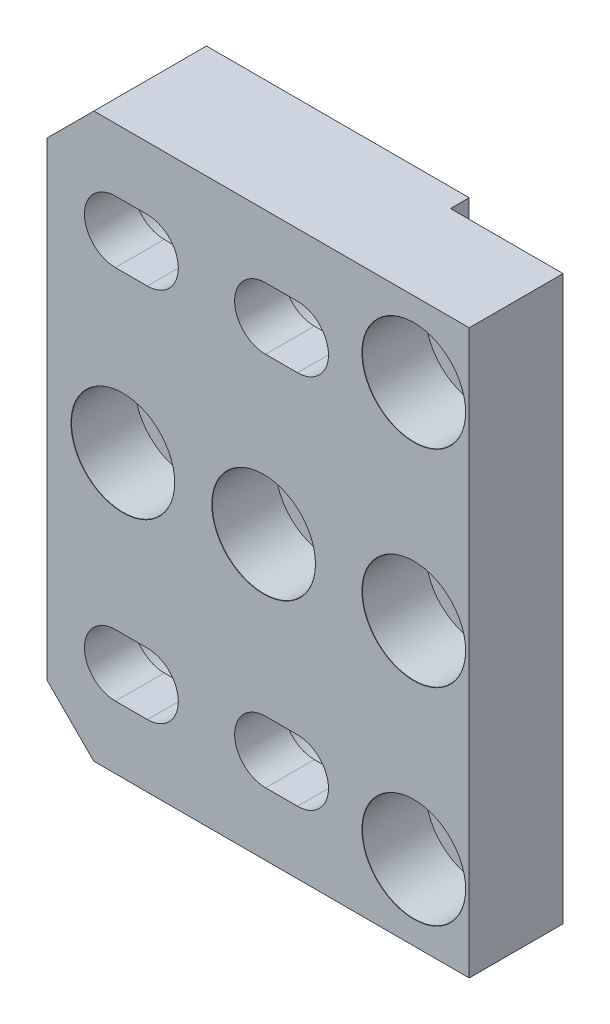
ISO-10303-21;
HEADER;
FILE_DESCRIPTION(('STEP AP214'),'2;1');
FILE_NAME('part.step','',(''),(''),'','','');
FILE_SCHEMA(('AUTOMOTIVE_DESIGN { 1 0 10303 214 1 1 1 1 }'));
ENDSEC;
DATA;
#1=APPLICATION_CONTEXT('core data for automotive mechanical design processes');
#2=APPLICATION_PROTOCOL_DEFINITION('international standard','automotive_design',2000,#1);
#3=PRODUCT_CONTEXT('',#1,'mechanical');
#4=PRODUCT('Part','Part','',(#3));
#5=PRODUCT_RELATED_PRODUCT_CATEGORY('part','',(#4));
#6=PRODUCT_DEFINITION_FORMATION('','',#4);
#7=PRODUCT_DEFINITION_CONTEXT('part definition',#1,'design');
#8=PRODUCT_DEFINITION('design','',#6,#7);
#9=PRODUCT_DEFINITION_SHAPE('','',#8);
#10=(LENGTH_UNIT() NAMED_UNIT(*) SI_UNIT(.MILLI.,.METRE.));
#11=(NAMED_UNIT(*) PLANE_ANGLE_UNIT() SI_UNIT($,.RADIAN.));
#12=(NAMED_UNIT(*) SI_UNIT($,.STERADIAN.) SOLID_ANGLE_UNIT());
#13=UNCERTAINTY_MEASURE_WITH_UNIT(LENGTH_MEASURE(1.E-05),#10,'distance_accuracy_value','');
#14=(GEOMETRIC_REPRESENTATION_CONTEXT(3) GLOBAL_UNCERTAINTY_ASSIGNED_CONTEXT((#13)) GLOBAL_UNIT_ASSIGNED_CONTEXT((#10,
#11,#12)) REPRESENTATION_CONTEXT('',''));
#15=CARTESIAN_POINT('',(0.,0.,0.));
#16=DIRECTION('',(0.,0.,1.));
#17=DIRECTION('',(1.,0.,0.));
#18=AXIS2_PLACEMENT_3D('',#15,#16,#17);
#19=CARTESIAN_POINT('',(0.,0.,0.));
#20=DIRECTION('',(0.,0.,-1.));
#21=DIRECTION('',(-1.,0.,0.));
#22=AXIS2_PLACEMENT_3D('',#19,#20,#21);
#23=PLANE('',#22);
#24=CARTESIAN_POINT('',(-62.3,-50.,0.));
#25=DIRECTION('',(0.,0.,-1.));
#26=DIRECTION('',(-1.,0.,0.));
#27=AXIS2_PLACEMENT_3D('',#24,#25,#26);
#28=CIRCLE('',#27,5.5);
#29=CARTESIAN_POINT('',(-62.3,-44.5,0.));
#30=VERTEX_POINT('',#29);
#31=CARTESIAN_POINT('',(-62.3,-55.5,0.));
#32=VERTEX_POINT('',#31);
#33=EDGE_CURVE('E319',#30,#32,#28,.T.);
#34=ORIENTED_EDGE('',*,*,#33,.F.);
#35=DIRECTION('',(1.,0.,0.));
#36=VECTOR('',#35,1.);
#37=CARTESIAN_POINT('',(-65.7,-44.5,0.));
#38=LINE('',#37,#36);
#39=CARTESIAN_POINT('',(-65.7,-44.5,0.));
#40=VERTEX_POINT('',#39);
#41=EDGE_CURVE('E301',#40,#30,#38,.T.);
#42=ORIENTED_EDGE('',*,*,#41,.F.);
#43=CARTESIAN_POINT('',(-65.7,-50.,0.));
#44=DIRECTION('',(0.,0.,-1.));
#45=DIRECTION('',(-1.,0.,0.));
#46=AXIS2_PLACEMENT_3D('',#43,#44,#45);
#47=CIRCLE('',#46,5.5);
#48=CARTESIAN_POINT('',(-65.7,-55.5,0.));
#49=VERTEX_POINT('',#48);
#50=EDGE_CURVE('E292',#49,#40,#47,.T.);
#51=ORIENTED_EDGE('',*,*,#50,.F.);
#52=DIRECTION('',(1.,0.,0.));
#53=VECTOR('',#52,1.);
#54=CARTESIAN_POINT('',(-65.7,-55.5,0.));
#55=LINE('',#54,#53);
#56=EDGE_CURVE('E275',#49,#32,#55,.T.);
#57=ORIENTED_EDGE('',*,*,#56,.T.);
#58=EDGE_LOOP('',(#34,#42,#51,#57));
#59=FACE_BOUND('',#58,.T.);
#60=CARTESIAN_POINT('',(-78.3,-10.,0.));
#61=DIRECTION('',(0.,0.,-1.));
#62=DIRECTION('',(-1.,0.,0.));
#63=AXIS2_PLACEMENT_3D('',#60,#61,#62);
#64=CIRCLE('',#63,5.5);
#65=CARTESIAN_POINT('',(-78.3,-4.5,0.));
#66=VERTEX_POINT('',#65);
#67=CARTESIAN_POINT('',(-78.3,-15.5,0.));
#68=VERTEX_POINT('',#67);
#69=EDGE_CURVE('E446',#66,#68,#64,.T.);
#70=ORIENTED_EDGE('',*,*,#69,.F.);
#71=DIRECTION('',(1.,0.,0.));
#72=VECTOR('',#71,1.);
#73=CARTESIAN_POINT('',(-81.7,-4.5,0.));
#74=LINE('',#73,#72);
#75=CARTESIAN_POINT('',(-81.7,-4.5,0.));
#76=VERTEX_POINT('',#75);
#77=EDGE_CURVE('E399',#76,#66,#74,.T.);
#78=ORIENTED_EDGE('',*,*,#77,.F.);
#79=CARTESIAN_POINT('',(-81.7,-10.,0.));
#80=DIRECTION('',(0.,0.,-1.));
#81=DIRECTION('',(-1.,0.,0.));
#82=AXIS2_PLACEMENT_3D('',#79,#80,#81);
#83=CIRCLE('',#82,5.5);
#84=CARTESIAN_POINT('',(-81.7,-15.5,0.));
#85=VERTEX_POINT('',#84);
#86=EDGE_CURVE('E424',#85,#76,#83,.T.);
#87=ORIENTED_EDGE('',*,*,#86,.F.);
#88=DIRECTION('',(1.,0.,0.));
#89=VECTOR('',#88,1.);
#90=CARTESIAN_POINT('',(-81.7,-15.5,0.));
#91=LINE('',#90,#89);
#92=EDGE_CURVE('E416',#85,#68,#91,.T.);
#93=ORIENTED_EDGE('',*,*,#92,.T.);
#94=EDGE_LOOP('',(#70,#78,#87,#93));
#95=FACE_BOUND('',#94,.T.);
#96=CARTESIAN_POINT('',(-65.9093619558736,-30.,0.));
#97=DIRECTION('',(0.,0.,1.));
#98=DIRECTION('',(1.,0.,0.));
#99=AXIS2_PLACEMENT_3D('',#96,#97,#98);
#100=CIRCLE('',#99,3.325);
#101=CARTESIAN_POINT('',(-62.5843619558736,-30.,0.));
#102=VERTEX_POINT('',#101);
#103=EDGE_CURVE('E590',#102,#102,#100,.T.);
#104=ORIENTED_EDGE('',*,*,#103,.T.);
#105=EDGE_LOOP('',(#104));
#106=FACE_BOUND('',#105,.T.);
#107=CARTESIAN_POINT('',(-80.9093619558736,-30.,0.));
#108=DIRECTION('',(0.,0.,1.));
#109=DIRECTION('',(1.,0.,0.));
#110=AXIS2_PLACEMENT_3D('',#107,#108,#109);
#111=CIRCLE('',#110,3.325);
#112=CARTESIAN_POINT('',(-77.5843619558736,-30.,0.));
#113=VERTEX_POINT('',#112);
#114=EDGE_CURVE('E611',#113,#113,#111,.T.);
#115=ORIENTED_EDGE('',*,*,#114,.T.);
#116=EDGE_LOOP('',(#115));
#117=FACE_BOUND('',#116,.T.);
#118=DIRECTION('',(0.,-1.,0.));
#119=VECTOR('',#118,1.);
#120=CARTESIAN_POINT('',(-89.,0.,0.));
#121=LINE('',#120,#119);
#122=CARTESIAN_POINT('',(-89.,-5.,0.));
#123=VERTEX_POINT('',#122);
#124=CARTESIAN_POINT('',(-89.,-55.,0.));
#125=VERTEX_POINT('',#124);
#126=EDGE_CURVE('E664',#123,#125,#121,.T.);
#127=ORIENTED_EDGE('',*,*,#126,.F.);
#128=DIRECTION('',(-0.707106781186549,-0.707106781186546,0.));
#129=VECTOR('',#128,1.);
#130=CARTESIAN_POINT('',(-42.,42.,0.));
#131=LINE('',#130,#129);
#132=CARTESIAN_POINT('',(-84.,0.,0.));
#133=VERTEX_POINT('',#132);
#134=EDGE_CURVE('E680',#123,#133,#131,.F.);
#135=ORIENTED_EDGE('',*,*,#134,.T.);
#136=DIRECTION('',(-1.,0.,0.));
#137=VECTOR('',#136,1.);
#138=CARTESIAN_POINT('',(-44.,0.,0.));
#139=LINE('',#138,#137);
#140=CARTESIAN_POINT('',(-56.,0.,0.));
#141=VERTEX_POINT('',#140);
#142=EDGE_CURVE('E648',#141,#133,#139,.T.);
#143=ORIENTED_EDGE('',*,*,#142,.F.);
#144=DIRECTION('',(0.,-1.,0.));
#145=VECTOR('',#144,1.);
#146=CARTESIAN_POINT('',(-56.,0.,0.));
#147=LINE('',#146,#145);
#148=CARTESIAN_POINT('',(-56.,-60.,0.));
#149=VERTEX_POINT('',#148);
#150=EDGE_CURVE('E645',#141,#149,#147,.T.);
#151=ORIENTED_EDGE('',*,*,#150,.T.);
#152=DIRECTION('',(1.,0.,0.));
#153=VECTOR('',#152,1.);
#154=CARTESIAN_POINT('',(-44.,-60.,0.));
#155=LINE('',#154,#153);
#156=CARTESIAN_POINT('',(-84.,-60.,0.));
#157=VERTEX_POINT('',#156);
#158=EDGE_CURVE('E656',#157,#149,#155,.T.);
#159=ORIENTED_EDGE('',*,*,#158,.F.);
#160=DIRECTION('',(0.707106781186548,-0.707106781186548,0.));
#161=VECTOR('',#160,1.);
#162=CARTESIAN_POINT('',(-72.,-72.,0.));
#163=LINE('',#162,#161);
#164=EDGE_CURVE('E678',#157,#125,#163,.F.);
#165=ORIENTED_EDGE('',*,*,#164,.T.);
#166=EDGE_LOOP('',(#127,#135,#143,#151,#159,#165));
#167=FACE_BOUND('',#166,.T.);
#168=CARTESIAN_POINT('',(-65.7,-10.,0.));
#169=DIRECTION('',(0.,0.,-1.));
#170=DIRECTION('',(-1.,0.,0.));
#171=AXIS2_PLACEMENT_3D('',#168,#169,#170);
#172=CIRCLE('',#171,5.5);
#173=CARTESIAN_POINT('',(-65.7,-15.5,0.));
#174=VERTEX_POINT('',#173);
#175=CARTESIAN_POINT('',(-65.7,-4.5,0.));
#176=VERTEX_POINT('',#175);
#177=EDGE_CURVE('E488',#174,#176,#172,.T.);
#178=ORIENTED_EDGE('',*,*,#177,.F.);
#179=DIRECTION('',(1.,0.,0.));
#180=VECTOR('',#179,1.);
#181=CARTESIAN_POINT('',(-65.7,-15.5,0.));
#182=LINE('',#181,#180);
#183=CARTESIAN_POINT('',(-62.3,-15.5,0.));
#184=VERTEX_POINT('',#183);
#185=EDGE_CURVE('E480',#174,#184,#182,.T.);
#186=ORIENTED_EDGE('',*,*,#185,.T.);
#187=CARTESIAN_POINT('',(-62.3,-10.,0.));
#188=DIRECTION('',(0.,0.,-1.));
#189=DIRECTION('',(-1.,0.,0.));
#190=AXIS2_PLACEMENT_3D('',#187,#188,#189);
#191=CIRCLE('',#190,5.5);
#192=CARTESIAN_POINT('',(-62.3,-4.5,0.));
#193=VERTEX_POINT('',#192);
#194=EDGE_CURVE('E510',#193,#184,#191,.T.);
#195=ORIENTED_EDGE('',*,*,#194,.F.);
#196=DIRECTION('',(1.,0.,0.));
#197=VECTOR('',#196,1.);
#198=CARTESIAN_POINT('',(-65.7,-4.5,0.));
#199=LINE('',#198,#197);
#200=EDGE_CURVE('E463',#176,#193,#199,.T.);
#201=ORIENTED_EDGE('',*,*,#200,.F.);
#202=EDGE_LOOP('',(#178,#186,#195,#201));
#203=FACE_BOUND('',#202,.T.);
#204=CARTESIAN_POINT('',(-81.7,-50.,0.));
#205=DIRECTION('',(0.,0.,-1.));
#206=DIRECTION('',(-1.,0.,0.));
#207=AXIS2_PLACEMENT_3D('',#204,#205,#206);
#208=CIRCLE('',#207,5.5);
#209=CARTESIAN_POINT('',(-81.7,-55.5,0.));
#210=VERTEX_POINT('',#209);
#211=CARTESIAN_POINT('',(-81.7,-44.5,0.));
#212=VERTEX_POINT('',#211);
#213=EDGE_CURVE('E359',#210,#212,#208,.T.);
#214=ORIENTED_EDGE('',*,*,#213,.F.);
#215=DIRECTION('',(1.,0.,0.));
#216=VECTOR('',#215,1.);
#217=CARTESIAN_POINT('',(-81.7,-55.5,0.));
#218=LINE('',#217,#216);
#219=CARTESIAN_POINT('',(-78.3,-55.5,0.));
#220=VERTEX_POINT('',#219);
#221=EDGE_CURVE('E351',#210,#220,#218,.T.);
#222=ORIENTED_EDGE('',*,*,#221,.T.);
#223=CARTESIAN_POINT('',(-78.3,-50.,0.));
#224=DIRECTION('',(0.,0.,-1.));
#225=DIRECTION('',(-1.,0.,0.));
#226=AXIS2_PLACEMENT_3D('',#223,#224,#225);
#227=CIRCLE('',#226,5.5);
#228=CARTESIAN_POINT('',(-78.3,-44.5,0.));
#229=VERTEX_POINT('',#228);
#230=EDGE_CURVE('E382',#229,#220,#227,.T.);
#231=ORIENTED_EDGE('',*,*,#230,.F.);
#232=DIRECTION('',(1.,0.,0.));
#233=VECTOR('',#232,1.);
#234=CARTESIAN_POINT('',(-81.7,-44.5,0.));
#235=LINE('',#234,#233);
#236=EDGE_CURVE('E334',#212,#229,#235,.T.);
#237=ORIENTED_EDGE('',*,*,#236,.F.);
#238=EDGE_LOOP('',(#214,#222,#231,#237));
#239=FACE_BOUND('',#238,.T.);
#240=ADVANCED_FACE('F16',(#59,#95,#106,#117,#167,#203,#239),#23,.T.);
#241=CARTESIAN_POINT('',(0.,0.,12.));
#242=DIRECTION('',(0.,0.,-1.));
#243=DIRECTION('',(-1.,0.,0.));
#244=AXIS2_PLACEMENT_3D('',#241,#242,#243);
#245=PLANE('',#244);
#246=DIRECTION('',(1.,0.,0.));
#247=VECTOR('',#246,1.);
#248=CARTESIAN_POINT('',(-65.7,-53.3,12.));
#249=LINE('',#248,#247);
#250=CARTESIAN_POINT('',(-65.7,-53.3,12.));
#251=VERTEX_POINT('',#250);
#252=CARTESIAN_POINT('',(-62.3,-53.3,12.));
#253=VERTEX_POINT('',#252);
#254=EDGE_CURVE('E1026',#251,#253,#249,.T.);
#255=ORIENTED_EDGE('',*,*,#254,.F.);
#256=CARTESIAN_POINT('',(-65.7,-50.,12.));
#257=DIRECTION('',(0.,0.,-1.));
#258=DIRECTION('',(-1.,0.,0.));
#259=AXIS2_PLACEMENT_3D('',#256,#257,#258);
#260=CIRCLE('',#259,3.3);
#261=CARTESIAN_POINT('',(-65.7,-46.7,12.));
#262=VERTEX_POINT('',#261);
#263=EDGE_CURVE('E311',#251,#262,#260,.T.);
#264=ORIENTED_EDGE('',*,*,#263,.T.);
#265=DIRECTION('',(1.,0.,0.));
#266=VECTOR('',#265,1.);
#267=CARTESIAN_POINT('',(-65.7,-46.7,12.));
#268=LINE('',#267,#266);
#269=CARTESIAN_POINT('',(-62.3,-46.7,12.));
#270=VERTEX_POINT('',#269);
#271=EDGE_CURVE('E1020',#262,#270,#268,.T.);
#272=ORIENTED_EDGE('',*,*,#271,.T.);
#273=CARTESIAN_POINT('',(-62.3,-50.,12.));
#274=DIRECTION('',(0.,0.,-1.));
#275=DIRECTION('',(-1.,0.,0.));
#276=AXIS2_PLACEMENT_3D('',#273,#274,#275);
#277=CIRCLE('',#276,3.3);
#278=EDGE_CURVE('E327',#270,#253,#277,.T.);
#279=ORIENTED_EDGE('',*,*,#278,.T.);
#280=EDGE_LOOP('',(#255,#264,#272,#279));
#281=FACE_BOUND('',#280,.T.);
#282=DIRECTION('',(1.,0.,0.));
#283=VECTOR('',#282,1.);
#284=CARTESIAN_POINT('',(-81.7,-46.7,12.));
#285=LINE('',#284,#283);
#286=CARTESIAN_POINT('',(-81.7,-46.7,12.));
#287=VERTEX_POINT('',#286);
#288=CARTESIAN_POINT('',(-78.3,-46.7,12.));
#289=VERTEX_POINT('',#288);
#290=EDGE_CURVE('E342',#287,#289,#285,.T.);
#291=ORIENTED_EDGE('',*,*,#290,.T.);
#292=CARTESIAN_POINT('',(-78.3,-50.,12.));
#293=DIRECTION('',(0.,0.,-1.));
#294=DIRECTION('',(-1.,0.,0.));
#295=AXIS2_PLACEMENT_3D('',#292,#293,#294);
#296=CIRCLE('',#295,3.3);
#297=CARTESIAN_POINT('',(-78.3,-53.3,12.));
#298=VERTEX_POINT('',#297);
#299=EDGE_CURVE('E391',#289,#298,#296,.T.);
#300=ORIENTED_EDGE('',*,*,#299,.T.);
#301=DIRECTION('',(1.,0.,0.));
#302=VECTOR('',#301,1.);
#303=CARTESIAN_POINT('',(-81.7,-53.3,12.));
#304=LINE('',#303,#302);
#305=CARTESIAN_POINT('',(-81.7,-53.3,12.));
#306=VERTEX_POINT('',#305);
#307=EDGE_CURVE('E345',#306,#298,#304,.T.);
#308=ORIENTED_EDGE('',*,*,#307,.F.);
#309=CARTESIAN_POINT('',(-81.7,-50.,12.));
#310=DIRECTION('',(0.,0.,-1.));
#311=DIRECTION('',(-1.,0.,0.));
#312=AXIS2_PLACEMENT_3D('',#309,#310,#311);
#313=CIRCLE('',#312,3.3);
#314=EDGE_CURVE('E367',#306,#287,#313,.T.);
#315=ORIENTED_EDGE('',*,*,#314,.T.);
#316=EDGE_LOOP('',(#291,#300,#308,#315));
#317=FACE_BOUND('',#316,.T.);
#318=CARTESIAN_POINT('',(-78.3,-10.,12.));
#319=DIRECTION('',(0.,0.,-1.));
#320=DIRECTION('',(-1.,0.,0.));
#321=AXIS2_PLACEMENT_3D('',#318,#319,#320);
#322=CIRCLE('',#321,3.3);
#323=CARTESIAN_POINT('',(-78.3,-6.7,12.));
#324=VERTEX_POINT('',#323);
#325=CARTESIAN_POINT('',(-78.3,-13.3,12.));
#326=VERTEX_POINT('',#325);
#327=EDGE_CURVE('E455',#324,#326,#322,.T.);
#328=ORIENTED_EDGE('',*,*,#327,.T.);
#329=DIRECTION('',(1.,0.,0.));
#330=VECTOR('',#329,1.);
#331=CARTESIAN_POINT('',(-81.7,-13.3,12.));
#332=LINE('',#331,#330);
#333=CARTESIAN_POINT('',(-81.7,-13.3,12.));
#334=VERTEX_POINT('',#333);
#335=EDGE_CURVE('E410',#334,#326,#332,.T.);
#336=ORIENTED_EDGE('',*,*,#335,.F.);
#337=CARTESIAN_POINT('',(-81.7,-10.,12.));
#338=DIRECTION('',(0.,0.,-1.));
#339=DIRECTION('',(-1.,0.,0.));
#340=AXIS2_PLACEMENT_3D('',#337,#338,#339);
#341=CIRCLE('',#340,3.3);
#342=CARTESIAN_POINT('',(-81.7,-6.7,12.));
#343=VERTEX_POINT('',#342);
#344=EDGE_CURVE('E432',#334,#343,#341,.T.);
#345=ORIENTED_EDGE('',*,*,#344,.T.);
#346=DIRECTION('',(1.,0.,0.));
#347=VECTOR('',#346,1.);
#348=CARTESIAN_POINT('',(-81.7,-6.7,12.));
#349=LINE('',#348,#347);
#350=EDGE_CURVE('E407',#343,#324,#349,.T.);
#351=ORIENTED_EDGE('',*,*,#350,.T.);
#352=EDGE_LOOP('',(#328,#336,#345,#351));
#353=FACE_BOUND('',#352,.T.);
#354=DIRECTION('',(-1.,0.,0.));
#355=VECTOR('',#354,1.);
#356=CARTESIAN_POINT('',(-44.,0.,12.));
#357=LINE('',#356,#355);
#358=CARTESIAN_POINT('',(-44.,0.,12.));
#359=VERTEX_POINT('',#358);
#360=CARTESIAN_POINT('',(-84.,0.,12.));
#361=VERTEX_POINT('',#360);
#362=EDGE_CURVE('E655',#359,#361,#357,.T.);
#363=ORIENTED_EDGE('',*,*,#362,.T.);
#364=DIRECTION('',(0.707106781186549,0.707106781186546,0.));
#365=VECTOR('',#364,1.);
#366=CARTESIAN_POINT('',(-89.,-5.,12.));
#367=LINE('',#366,#365);
#368=CARTESIAN_POINT('',(-89.,-5.,12.));
#369=VERTEX_POINT('',#368);
#370=EDGE_CURVE('E24',#361,#369,#367,.F.);
#371=ORIENTED_EDGE('',*,*,#370,.T.);
#372=DIRECTION('',(0.,-1.,0.));
#373=VECTOR('',#372,1.);
#374=CARTESIAN_POINT('',(-89.,0.,12.));
#375=LINE('',#374,#373);
#376=CARTESIAN_POINT('',(-89.,-55.,12.));
#377=VERTEX_POINT('',#376);
#378=EDGE_CURVE('E658',#369,#377,#375,.T.);
#379=ORIENTED_EDGE('',*,*,#378,.T.);
#380=DIRECTION('',(-0.707106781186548,0.707106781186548,0.));
#381=VECTOR('',#380,1.);
#382=CARTESIAN_POINT('',(-84.,-60.,12.));
#383=LINE('',#382,#381);
#384=CARTESIAN_POINT('',(-84.,-60.,12.));
#385=VERTEX_POINT('',#384);
#386=EDGE_CURVE('E31',#377,#385,#383,.F.);
#387=ORIENTED_EDGE('',*,*,#386,.T.);
#388=DIRECTION('',(1.,0.,0.));
#389=VECTOR('',#388,1.);
#390=CARTESIAN_POINT('',(-44.,-60.,12.));
#391=LINE('',#390,#389);
#392=CARTESIAN_POINT('',(-44.,-60.,12.));
#393=VERTEX_POINT('',#392);
#394=EDGE_CURVE('E660',#385,#393,#391,.T.);
#395=ORIENTED_EDGE('',*,*,#394,.T.);
#396=DIRECTION('',(0.,1.,0.));
#397=VECTOR('',#396,1.);
#398=CARTESIAN_POINT('',(-44.,0.,12.));
#399=LINE('',#398,#397);
#400=EDGE_CURVE('E652',#393,#359,#399,.T.);
#401=ORIENTED_EDGE('',*,*,#400,.T.);
#402=EDGE_LOOP('',(#363,#371,#379,#387,#395,#401));
#403=FACE_BOUND('',#402,.T.);
#404=CARTESIAN_POINT('',(-80.9093619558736,-30.,12.));
#405=DIRECTION('',(0.,0.,1.));
#406=DIRECTION('',(1.,0.,0.));
#407=AXIS2_PLACEMENT_3D('',#404,#405,#406);
#408=CIRCLE('',#407,5.525);
#409=CARTESIAN_POINT('',(-75.3843619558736,-30.,12.));
#410=VERTEX_POINT('',#409);
#411=EDGE_CURVE('E614',#410,#410,#408,.T.);
#412=ORIENTED_EDGE('',*,*,#411,.F.);
#413=EDGE_LOOP('',(#412));
#414=FACE_BOUND('',#413,.T.);
#415=CARTESIAN_POINT('',(-65.9093619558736,-30.,12.));
#416=DIRECTION('',(0.,0.,1.));
#417=DIRECTION('',(1.,0.,0.));
#418=AXIS2_PLACEMENT_3D('',#415,#416,#417);
#419=CIRCLE('',#418,5.525);
#420=CARTESIAN_POINT('',(-60.3843619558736,-30.,12.));
#421=VERTEX_POINT('',#420);
#422=EDGE_CURVE('E593',#421,#421,#419,.T.);
#423=ORIENTED_EDGE('',*,*,#422,.F.);
#424=EDGE_LOOP('',(#423));
#425=FACE_BOUND('',#424,.T.);
#426=CARTESIAN_POINT('',(-49.9093619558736,-52.,12.));
#427=DIRECTION('',(0.,0.,1.));
#428=DIRECTION('',(1.,0.,0.));
#429=AXIS2_PLACEMENT_3D('',#426,#427,#428);
#430=CIRCLE('',#429,5.525);
#431=CARTESIAN_POINT('',(-44.3843619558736,-52.,12.));
#432=VERTEX_POINT('',#431);
#433=EDGE_CURVE('E572',#432,#432,#430,.T.);
#434=ORIENTED_EDGE('',*,*,#433,.F.);
#435=EDGE_LOOP('',(#434));
#436=FACE_BOUND('',#435,.T.);
#437=CARTESIAN_POINT('',(-49.9093619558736,-30.,12.));
#438=DIRECTION('',(0.,0.,1.));
#439=DIRECTION('',(1.,0.,0.));
#440=AXIS2_PLACEMENT_3D('',#437,#438,#439);
#441=CIRCLE('',#440,5.525);
#442=CARTESIAN_POINT('',(-44.3843619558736,-30.,12.));
#443=VERTEX_POINT('',#442);
#444=EDGE_CURVE('E551',#443,#443,#441,.T.);
#445=ORIENTED_EDGE('',*,*,#444,.F.);
#446=EDGE_LOOP('',(#445));
#447=FACE_BOUND('',#446,.T.);
#448=CARTESIAN_POINT('',(-49.9093619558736,-8.,12.));
#449=DIRECTION('',(0.,0.,1.));
#450=DIRECTION('',(1.,0.,0.));
#451=AXIS2_PLACEMENT_3D('',#448,#449,#450);
#452=CIRCLE('',#451,5.525);
#453=CARTESIAN_POINT('',(-44.3843619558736,-8.,12.));
#454=VERTEX_POINT('',#453);
#455=EDGE_CURVE('E530',#454,#454,#452,.T.);
#456=ORIENTED_EDGE('',*,*,#455,.F.);
#457=EDGE_LOOP('',(#456));
#458=FACE_BOUND('',#457,.T.);
#459=DIRECTION('',(1.,0.,0.));
#460=VECTOR('',#459,1.);
#461=CARTESIAN_POINT('',(-65.7,-13.3,12.));
#462=LINE('',#461,#460);
#463=CARTESIAN_POINT('',(-65.7,-13.3,12.));
#464=VERTEX_POINT('',#463);
#465=CARTESIAN_POINT('',(-62.3,-13.3,12.));
#466=VERTEX_POINT('',#465);
#467=EDGE_CURVE('E474',#464,#466,#462,.T.);
#468=ORIENTED_EDGE('',*,*,#467,.F.);
#469=CARTESIAN_POINT('',(-65.7,-10.,12.));
#470=DIRECTION('',(0.,0.,-1.));
#471=DIRECTION('',(-1.,0.,0.));
#472=AXIS2_PLACEMENT_3D('',#469,#470,#471);
#473=CIRCLE('',#472,3.3);
#474=CARTESIAN_POINT('',(-65.7,-6.7,12.));
#475=VERTEX_POINT('',#474);
#476=EDGE_CURVE('E496',#464,#475,#473,.T.);
#477=ORIENTED_EDGE('',*,*,#476,.T.);
#478=DIRECTION('',(1.,0.,0.));
#479=VECTOR('',#478,1.);
#480=CARTESIAN_POINT('',(-65.7,-6.7,12.));
#481=LINE('',#480,#479);
#482=CARTESIAN_POINT('',(-62.3,-6.7,12.));
#483=VERTEX_POINT('',#482);
#484=EDGE_CURVE('E471',#475,#483,#481,.T.);
#485=ORIENTED_EDGE('',*,*,#484,.T.);
#486=CARTESIAN_POINT('',(-62.3,-10.,12.));
#487=DIRECTION('',(0.,0.,-1.));
#488=DIRECTION('',(-1.,0.,0.));
#489=AXIS2_PLACEMENT_3D('',#486,#487,#488);
#490=CIRCLE('',#489,3.3);
#491=EDGE_CURVE('E519',#483,#466,#490,.T.);
#492=ORIENTED_EDGE('',*,*,#491,.T.);
#493=EDGE_LOOP('',(#468,#477,#485,#492));
#494=FACE_BOUND('',#493,.T.);
#495=ADVANCED_FACE('F685',(#281,#317,#353,#403,#414,#425,#436,#447,#458,#494),#245,.F.);
#496=CARTESIAN_POINT('',(-44.,0.,12.));
#497=DIRECTION('',(-1.,0.,0.));
#498=DIRECTION('',(0.,0.,1.));
#499=AXIS2_PLACEMENT_3D('',#496,#497,#498);
#500=PLANE('',#499);
#501=DIRECTION('',(0.,0.,-1.));
#502=VECTOR('',#501,1.);
#503=CARTESIAN_POINT('',(-44.,-60.,12.));
#504=LINE('',#503,#502);
#505=CARTESIAN_POINT('',(-44.,-60.,2.));
#506=VERTEX_POINT('',#505);
#507=EDGE_CURVE('E662',#393,#506,#504,.T.);
#508=ORIENTED_EDGE('',*,*,#507,.T.);
#509=DIRECTION('',(0.,-1.,0.));
#510=VECTOR('',#509,1.);
#511=CARTESIAN_POINT('',(-44.,0.,2.));
#512=LINE('',#511,#510);
#513=CARTESIAN_POINT('',(-44.,0.,2.));
#514=VERTEX_POINT('',#513);
#515=EDGE_CURVE('E640',#514,#506,#512,.T.);
#516=ORIENTED_EDGE('',*,*,#515,.F.);
#517=DIRECTION('',(0.,0.,-1.));
#518=VECTOR('',#517,1.);
#519=CARTESIAN_POINT('',(-44.,0.,12.));
#520=LINE('',#519,#518);
#521=EDGE_CURVE('E670',#359,#514,#520,.T.);
#522=ORIENTED_EDGE('',*,*,#521,.F.);
#523=ORIENTED_EDGE('',*,*,#400,.F.);
#524=EDGE_LOOP('',(#508,#516,#522,#523));
#525=FACE_BOUND('',#524,.T.);
#526=ADVANCED_FACE('F722',(#525),#500,.F.);
#527=CARTESIAN_POINT('',(-44.,0.,12.));
#528=DIRECTION('',(0.,-1.,0.));
#529=DIRECTION('',(1.,0.,0.));
#530=AXIS2_PLACEMENT_3D('',#527,#528,#529);
#531=PLANE('',#530);
#532=ORIENTED_EDGE('',*,*,#142,.T.);
#533=DIRECTION('',(0.,0.,1.));
#534=VECTOR('',#533,1.);
#535=CARTESIAN_POINT('',(-84.,0.,12.));
#536=LINE('',#535,#534);
#537=EDGE_CURVE('E39',#133,#361,#536,.T.);
#538=ORIENTED_EDGE('',*,*,#537,.T.);
#539=ORIENTED_EDGE('',*,*,#362,.F.);
#540=ORIENTED_EDGE('',*,*,#521,.T.);
#541=DIRECTION('',(-1.,0.,0.));
#542=VECTOR('',#541,1.);
#543=CARTESIAN_POINT('',(-44.,0.,2.));
#544=LINE('',#543,#542);
#545=CARTESIAN_POINT('',(-56.,0.,2.));
#546=VERTEX_POINT('',#545);
#547=EDGE_CURVE('E633',#514,#546,#544,.T.);
#548=ORIENTED_EDGE('',*,*,#547,.T.);
#549=DIRECTION('',(0.,0.,-1.));
#550=VECTOR('',#549,1.);
#551=CARTESIAN_POINT('',(-56.,0.,0.));
#552=LINE('',#551,#550);
#553=EDGE_CURVE('E636',#546,#141,#552,.T.);
#554=ORIENTED_EDGE('',*,*,#553,.T.);
#555=EDGE_LOOP('',(#532,#538,#539,#540,#548,#554));
#556=FACE_BOUND('',#555,.T.);
#557=ADVANCED_FACE('F697',(#556),#531,.F.);
#558=CARTESIAN_POINT('',(-89.,0.,12.));
#559=DIRECTION('',(1.,0.,0.));
#560=DIRECTION('',(0.,0.,-1.));
#561=AXIS2_PLACEMENT_3D('',#558,#559,#560);
#562=PLANE('',#561);
#563=ORIENTED_EDGE('',*,*,#378,.F.);
#564=DIRECTION('',(0.,0.,-1.));
#565=VECTOR('',#564,1.);
#566=CARTESIAN_POINT('',(-89.,-5.,12.));
#567=LINE('',#566,#565);
#568=EDGE_CURVE('E675',#369,#123,#567,.T.);
#569=ORIENTED_EDGE('',*,*,#568,.T.);
#570=ORIENTED_EDGE('',*,*,#126,.T.);
#571=DIRECTION('',(0.,0.,1.));
#572=VECTOR('',#571,1.);
#573=CARTESIAN_POINT('',(-89.,-55.,12.));
#574=LINE('',#573,#572);
#575=EDGE_CURVE('E673',#125,#377,#574,.T.);
#576=ORIENTED_EDGE('',*,*,#575,.T.);
#577=EDGE_LOOP('',(#563,#569,#570,#576));
#578=FACE_BOUND('',#577,.T.);
#579=ADVANCED_FACE('F690',(#578),#562,.F.);
#580=CARTESIAN_POINT('',(-44.,-60.,12.));
#581=DIRECTION('',(0.,1.,0.));
#582=DIRECTION('',(-1.,0.,0.));
#583=AXIS2_PLACEMENT_3D('',#580,#581,#582);
#584=PLANE('',#583);
#585=ORIENTED_EDGE('',*,*,#394,.F.);
#586=DIRECTION('',(0.,0.,-1.));
#587=VECTOR('',#586,1.);
#588=CARTESIAN_POINT('',(-84.,-60.,12.));
#589=LINE('',#588,#587);
#590=EDGE_CURVE('E11',#385,#157,#589,.T.);
#591=ORIENTED_EDGE('',*,*,#590,.T.);
#592=ORIENTED_EDGE('',*,*,#158,.T.);
#593=DIRECTION('',(0.,0.,-1.));
#594=VECTOR('',#593,1.);
#595=CARTESIAN_POINT('',(-56.,-60.,0.));
#596=LINE('',#595,#594);
#597=CARTESIAN_POINT('',(-56.,-60.,2.));
#598=VERTEX_POINT('',#597);
#599=EDGE_CURVE('E637',#598,#149,#596,.T.);
#600=ORIENTED_EDGE('',*,*,#599,.F.);
#601=DIRECTION('',(-1.,0.,0.));
#602=VECTOR('',#601,1.);
#603=CARTESIAN_POINT('',(-44.,-60.,2.));
#604=LINE('',#603,#602);
#605=EDGE_CURVE('E632',#506,#598,#604,.T.);
#606=ORIENTED_EDGE('',*,*,#605,.F.);
#607=ORIENTED_EDGE('',*,*,#507,.F.);
#608=EDGE_LOOP('',(#585,#591,#592,#600,#606,#607));
#609=FACE_BOUND('',#608,.T.);
#610=ADVANCED_FACE('F704',(#609),#584,.F.);
#611=CARTESIAN_POINT('',(-56.,0.,0.));
#612=DIRECTION('',(-1.,0.,0.));
#613=DIRECTION('',(0.,-1.,0.));
#614=AXIS2_PLACEMENT_3D('',#611,#612,#613);
#615=PLANE('',#614);
#616=ORIENTED_EDGE('',*,*,#599,.T.);
#617=ORIENTED_EDGE('',*,*,#150,.F.);
#618=ORIENTED_EDGE('',*,*,#553,.F.);
#619=DIRECTION('',(0.,-1.,0.));
#620=VECTOR('',#619,1.);
#621=CARTESIAN_POINT('',(-56.,0.,2.));
#622=LINE('',#621,#620);
#623=EDGE_CURVE('E649',#546,#598,#622,.T.);
#624=ORIENTED_EDGE('',*,*,#623,.T.);
#625=EDGE_LOOP('',(#616,#617,#618,#624));
#626=FACE_BOUND('',#625,.T.);
#627=ADVANCED_FACE('F700',(#626),#615,.F.);
#628=CARTESIAN_POINT('',(-44.,0.,2.));
#629=DIRECTION('',(0.,0.,1.));
#630=DIRECTION('',(1.,0.,0.));
#631=AXIS2_PLACEMENT_3D('',#628,#629,#630);
#632=PLANE('',#631);
#633=CARTESIAN_POINT('',(-49.9093619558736,-8.,2.));
#634=DIRECTION('',(0.,0.,1.));
#635=DIRECTION('',(1.,0.,0.));
#636=AXIS2_PLACEMENT_3D('',#633,#634,#635);
#637=CIRCLE('',#636,3.325);
#638=CARTESIAN_POINT('',(-46.5843619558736,-8.,2.));
#639=VERTEX_POINT('',#638);
#640=EDGE_CURVE('E527',#639,#639,#637,.T.);
#641=ORIENTED_EDGE('',*,*,#640,.T.);
#642=EDGE_LOOP('',(#641));
#643=FACE_BOUND('',#642,.T.);
#644=CARTESIAN_POINT('',(-49.9093619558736,-30.,2.));
#645=DIRECTION('',(0.,0.,1.));
#646=DIRECTION('',(1.,0.,0.));
#647=AXIS2_PLACEMENT_3D('',#644,#645,#646);
#648=CIRCLE('',#647,3.325);
#649=CARTESIAN_POINT('',(-46.5843619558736,-30.,2.));
#650=VERTEX_POINT('',#649);
#651=EDGE_CURVE('E548',#650,#650,#648,.T.);
#652=ORIENTED_EDGE('',*,*,#651,.T.);
#653=EDGE_LOOP('',(#652));
#654=FACE_BOUND('',#653,.T.);
#655=CARTESIAN_POINT('',(-49.9093619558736,-52.,2.));
#656=DIRECTION('',(0.,0.,1.));
#657=DIRECTION('',(1.,0.,0.));
#658=AXIS2_PLACEMENT_3D('',#655,#656,#657);
#659=CIRCLE('',#658,3.325);
#660=CARTESIAN_POINT('',(-46.5843619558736,-52.,2.));
#661=VERTEX_POINT('',#660);
#662=EDGE_CURVE('E569',#661,#661,#659,.T.);
#663=ORIENTED_EDGE('',*,*,#662,.T.);
#664=EDGE_LOOP('',(#663));
#665=FACE_BOUND('',#664,.T.);
#666=ORIENTED_EDGE('',*,*,#605,.T.);
#667=ORIENTED_EDGE('',*,*,#623,.F.);
#668=ORIENTED_EDGE('',*,*,#547,.F.);
#669=ORIENTED_EDGE('',*,*,#515,.T.);
#670=EDGE_LOOP('',(#666,#667,#668,#669));
#671=FACE_BOUND('',#670,.T.);
#672=ADVANCED_FACE('F742',(#643,#654,#665,#671),#632,.F.);
#673=CARTESIAN_POINT('',(-80.9093619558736,-30.,0.024999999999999));
#674=DIRECTION('',(0.,0.,-1.));
#675=DIRECTION('',(-1.,0.,0.));
#676=AXIS2_PLACEMENT_3D('',#673,#674,#675);
#677=CONICAL_SURFACE('',#676,3.3,0.785398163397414);
#678=ORIENTED_EDGE('',*,*,#114,.F.);
#679=EDGE_LOOP('',(#678));
#680=FACE_BOUND('',#679,.T.);
#681=CARTESIAN_POINT('',(-80.9093619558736,-30.,0.024999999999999));
#682=DIRECTION('',(0.,0.,1.));
#683=DIRECTION('',(1.,0.,0.));
#684=AXIS2_PLACEMENT_3D('',#681,#682,#683);
#685=CIRCLE('',#684,3.3);
#686=CARTESIAN_POINT('',(-77.6093619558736,-30.,0.024999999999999));
#687=VERTEX_POINT('',#686);
#688=EDGE_CURVE('E629',#687,#687,#685,.T.);
#689=ORIENTED_EDGE('',*,*,#688,.T.);
#690=EDGE_LOOP('',(#689));
#691=FACE_BOUND('',#690,.T.);
#692=ADVANCED_FACE('F744',(#680,#691),#677,.F.);
#693=CARTESIAN_POINT('',(-80.9093619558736,-30.,12.));
#694=DIRECTION('',(0.,0.,1.));
#695=DIRECTION('',(1.,0.,0.));
#696=AXIS2_PLACEMENT_3D('',#693,#694,#695);
#697=CYLINDRICAL_SURFACE('',#696,3.3);
#698=ORIENTED_EDGE('',*,*,#688,.F.);
#699=EDGE_LOOP('',(#698));
#700=FACE_BOUND('',#699,.T.);
#701=CARTESIAN_POINT('',(-80.9093619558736,-30.,5.175));
#702=DIRECTION('',(0.,0.,1.));
#703=DIRECTION('',(1.,0.,0.));
#704=AXIS2_PLACEMENT_3D('',#701,#702,#703);
#705=CIRCLE('',#704,3.3);
#706=CARTESIAN_POINT('',(-77.6093619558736,-30.,5.175));
#707=VERTEX_POINT('',#706);
#708=EDGE_CURVE('E626',#707,#707,#705,.T.);
#709=ORIENTED_EDGE('',*,*,#708,.T.);
#710=EDGE_LOOP('',(#709));
#711=FACE_BOUND('',#710,.T.);
#712=ADVANCED_FACE('F751',(#700,#711),#697,.F.);
#713=CARTESIAN_POINT('',(-80.9093619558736,-30.,5.2));
#714=DIRECTION('',(0.,0.,1.));
#715=DIRECTION('',(1.,0.,0.));
#716=AXIS2_PLACEMENT_3D('',#713,#714,#715);
#717=CONICAL_SURFACE('',#716,3.325,0.785398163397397);
#718=ORIENTED_EDGE('',*,*,#708,.F.);
#719=EDGE_LOOP('',(#718));
#720=FACE_BOUND('',#719,.T.);
#721=CARTESIAN_POINT('',(-80.9093619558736,-30.,5.2));
#722=DIRECTION('',(0.,0.,1.));
#723=DIRECTION('',(1.,0.,0.));
#724=AXIS2_PLACEMENT_3D('',#721,#722,#723);
#725=CIRCLE('',#724,3.325);
#726=CARTESIAN_POINT('',(-77.5843619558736,-30.,5.2));
#727=VERTEX_POINT('',#726);
#728=EDGE_CURVE('E623',#727,#727,#725,.T.);
#729=ORIENTED_EDGE('',*,*,#728,.T.);
#730=EDGE_LOOP('',(#729));
#731=FACE_BOUND('',#730,.T.);
#732=ADVANCED_FACE('F759',(#720,#731),#717,.F.);
#733=CARTESIAN_POINT('',(-77.5843619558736,-30.,5.2));
#734=DIRECTION('',(0.,0.,-1.));
#735=DIRECTION('',(-1.,0.,0.));
#736=AXIS2_PLACEMENT_3D('',#733,#734,#735);
#737=PLANE('',#736);
#738=ORIENTED_EDGE('',*,*,#728,.F.);
#739=EDGE_LOOP('',(#738));
#740=FACE_BOUND('',#739,.T.);
#741=CARTESIAN_POINT('',(-80.9093619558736,-30.,5.2));
#742=DIRECTION('',(0.,0.,1.));
#743=DIRECTION('',(1.,0.,0.));
#744=AXIS2_PLACEMENT_3D('',#741,#742,#743);
#745=CIRCLE('',#744,5.5);
#746=CARTESIAN_POINT('',(-75.4093619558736,-30.,5.2));
#747=VERTEX_POINT('',#746);
#748=EDGE_CURVE('E620',#747,#747,#745,.T.);
#749=ORIENTED_EDGE('',*,*,#748,.T.);
#750=EDGE_LOOP('',(#749));
#751=FACE_BOUND('',#750,.T.);
#752=ADVANCED_FACE('F763',(#740,#751),#737,.F.);
#753=CARTESIAN_POINT('',(-80.9093619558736,-30.,12.));
#754=DIRECTION('',(0.,0.,1.));
#755=DIRECTION('',(1.,0.,0.));
#756=AXIS2_PLACEMENT_3D('',#753,#754,#755);
#757=CYLINDRICAL_SURFACE('',#756,5.5);
#758=ORIENTED_EDGE('',*,*,#748,.F.);
#759=EDGE_LOOP('',(#758));
#760=FACE_BOUND('',#759,.T.);
#761=CARTESIAN_POINT('',(-80.9093619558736,-30.,11.975));
#762=DIRECTION('',(0.,0.,1.));
#763=DIRECTION('',(1.,0.,0.));
#764=AXIS2_PLACEMENT_3D('',#761,#762,#763);
#765=CIRCLE('',#764,5.5);
#766=CARTESIAN_POINT('',(-75.4093619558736,-30.,11.975));
#767=VERTEX_POINT('',#766);
#768=EDGE_CURVE('E617',#767,#767,#765,.T.);
#769=ORIENTED_EDGE('',*,*,#768,.T.);
#770=EDGE_LOOP('',(#769));
#771=FACE_BOUND('',#770,.T.);
#772=ADVANCED_FACE('F767',(#760,#771),#757,.F.);
#773=CARTESIAN_POINT('',(-80.9093619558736,-30.,12.));
#774=DIRECTION('',(0.,0.,1.));
#775=DIRECTION('',(1.,0.,0.));
#776=AXIS2_PLACEMENT_3D('',#773,#774,#775);
#777=CONICAL_SURFACE('',#776,5.525,0.785398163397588);
#778=ORIENTED_EDGE('',*,*,#768,.F.);
#779=EDGE_LOOP('',(#778));
#780=FACE_BOUND('',#779,.T.);
#781=ORIENTED_EDGE('',*,*,#411,.T.);
#782=EDGE_LOOP('',(#781));
#783=FACE_BOUND('',#782,.T.);
#784=ADVANCED_FACE('F771',(#780,#783),#777,.F.);
#785=CARTESIAN_POINT('',(-65.9093619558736,-30.,0.024999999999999));
#786=DIRECTION('',(0.,0.,-1.));
#787=DIRECTION('',(-1.,0.,0.));
#788=AXIS2_PLACEMENT_3D('',#785,#786,#787);
#789=CONICAL_SURFACE('',#788,3.3,0.785398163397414);
#790=ORIENTED_EDGE('',*,*,#103,.F.);
#791=EDGE_LOOP('',(#790));
#792=FACE_BOUND('',#791,.T.);
#793=CARTESIAN_POINT('',(-65.9093619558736,-30.,0.024999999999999));
#794=DIRECTION('',(0.,0.,1.));
#795=DIRECTION('',(1.,0.,0.));
#796=AXIS2_PLACEMENT_3D('',#793,#794,#795);
#797=CIRCLE('',#796,3.3);
#798=CARTESIAN_POINT('',(-62.6093619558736,-30.,0.024999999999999));
#799=VERTEX_POINT('',#798);
#800=EDGE_CURVE('E608',#799,#799,#797,.T.);
#801=ORIENTED_EDGE('',*,*,#800,.T.);
#802=EDGE_LOOP('',(#801));
#803=FACE_BOUND('',#802,.T.);
#804=ADVANCED_FACE('F775',(#792,#803),#789,.F.);
#805=CARTESIAN_POINT('',(-65.9093619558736,-30.,12.));
#806=DIRECTION('',(0.,0.,1.));
#807=DIRECTION('',(1.,0.,0.));
#808=AXIS2_PLACEMENT_3D('',#805,#806,#807);
#809=CYLINDRICAL_SURFACE('',#808,3.3);
#810=ORIENTED_EDGE('',*,*,#800,.F.);
#811=EDGE_LOOP('',(#810));
#812=FACE_BOUND('',#811,.T.);
#813=CARTESIAN_POINT('',(-65.9093619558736,-30.,5.175));
#814=DIRECTION('',(0.,0.,1.));
#815=DIRECTION('',(1.,0.,0.));
#816=AXIS2_PLACEMENT_3D('',#813,#814,#815);
#817=CIRCLE('',#816,3.3);
#818=CARTESIAN_POINT('',(-62.6093619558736,-30.,5.175));
#819=VERTEX_POINT('',#818);
#820=EDGE_CURVE('E605',#819,#819,#817,.T.);
#821=ORIENTED_EDGE('',*,*,#820,.T.);
#822=EDGE_LOOP('',(#821));
#823=FACE_BOUND('',#822,.T.);
#824=ADVANCED_FACE('F779',(#812,#823),#809,.F.);
#825=CARTESIAN_POINT('',(-65.9093619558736,-30.,5.2));
#826=DIRECTION('',(0.,0.,1.));
#827=DIRECTION('',(1.,0.,0.));
#828=AXIS2_PLACEMENT_3D('',#825,#826,#827);
#829=CONICAL_SURFACE('',#828,3.325,0.785398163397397);
#830=ORIENTED_EDGE('',*,*,#820,.F.);
#831=EDGE_LOOP('',(#830));
#832=FACE_BOUND('',#831,.T.);
#833=CARTESIAN_POINT('',(-65.9093619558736,-30.,5.2));
#834=DIRECTION('',(0.,0.,1.));
#835=DIRECTION('',(1.,0.,0.));
#836=AXIS2_PLACEMENT_3D('',#833,#834,#835);
#837=CIRCLE('',#836,3.325);
#838=CARTESIAN_POINT('',(-62.5843619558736,-30.,5.2));
#839=VERTEX_POINT('',#838);
#840=EDGE_CURVE('E602',#839,#839,#837,.T.);
#841=ORIENTED_EDGE('',*,*,#840,.T.);
#842=EDGE_LOOP('',(#841));
#843=FACE_BOUND('',#842,.T.);
#844=ADVANCED_FACE('F783',(#832,#843),#829,.F.);
#845=CARTESIAN_POINT('',(-62.5843619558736,-30.,5.2));
#846=DIRECTION('',(0.,0.,-1.));
#847=DIRECTION('',(-1.,0.,0.));
#848=AXIS2_PLACEMENT_3D('',#845,#846,#847);
#849=PLANE('',#848);
#850=ORIENTED_EDGE('',*,*,#840,.F.);
#851=EDGE_LOOP('',(#850));
#852=FACE_BOUND('',#851,.T.);
#853=CARTESIAN_POINT('',(-65.9093619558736,-30.,5.2));
#854=DIRECTION('',(0.,0.,1.));
#855=DIRECTION('',(1.,0.,0.));
#856=AXIS2_PLACEMENT_3D('',#853,#854,#855);
#857=CIRCLE('',#856,5.5);
#858=CARTESIAN_POINT('',(-60.4093619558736,-30.,5.2));
#859=VERTEX_POINT('',#858);
#860=EDGE_CURVE('E599',#859,#859,#857,.T.);
#861=ORIENTED_EDGE('',*,*,#860,.T.);
#862=EDGE_LOOP('',(#861));
#863=FACE_BOUND('',#862,.T.);
#864=ADVANCED_FACE('F787',(#852,#863),#849,.F.);
#865=CARTESIAN_POINT('',(-65.9093619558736,-30.,12.));
#866=DIRECTION('',(0.,0.,1.));
#867=DIRECTION('',(1.,0.,0.));
#868=AXIS2_PLACEMENT_3D('',#865,#866,#867);
#869=CYLINDRICAL_SURFACE('',#868,5.5);
#870=ORIENTED_EDGE('',*,*,#860,.F.);
#871=EDGE_LOOP('',(#870));
#872=FACE_BOUND('',#871,.T.);
#873=CARTESIAN_POINT('',(-65.9093619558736,-30.,11.975));
#874=DIRECTION('',(0.,0.,1.));
#875=DIRECTION('',(1.,0.,0.));
#876=AXIS2_PLACEMENT_3D('',#873,#874,#875);
#877=CIRCLE('',#876,5.5);
#878=CARTESIAN_POINT('',(-60.4093619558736,-30.,11.975));
#879=VERTEX_POINT('',#878);
#880=EDGE_CURVE('E596',#879,#879,#877,.T.);
#881=ORIENTED_EDGE('',*,*,#880,.T.);
#882=EDGE_LOOP('',(#881));
#883=FACE_BOUND('',#882,.T.);
#884=ADVANCED_FACE('F791',(#872,#883),#869,.F.);
#885=CARTESIAN_POINT('',(-65.9093619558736,-30.,12.));
#886=DIRECTION('',(0.,0.,1.));
#887=DIRECTION('',(1.,0.,0.));
#888=AXIS2_PLACEMENT_3D('',#885,#886,#887);
#889=CONICAL_SURFACE('',#888,5.525,0.785398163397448);
#890=ORIENTED_EDGE('',*,*,#880,.F.);
#891=EDGE_LOOP('',(#890));
#892=FACE_BOUND('',#891,.T.);
#893=ORIENTED_EDGE('',*,*,#422,.T.);
#894=EDGE_LOOP('',(#893));
#895=FACE_BOUND('',#894,.T.);
#896=ADVANCED_FACE('F795',(#892,#895),#889,.F.);
#897=CARTESIAN_POINT('',(-49.9093619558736,-52.,2.025));
#898=DIRECTION('',(0.,0.,-1.));
#899=DIRECTION('',(-1.,0.,0.));
#900=AXIS2_PLACEMENT_3D('',#897,#898,#899);
#901=CONICAL_SURFACE('',#900,3.3,0.785398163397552);
#902=ORIENTED_EDGE('',*,*,#662,.F.);
#903=EDGE_LOOP('',(#902));
#904=FACE_BOUND('',#903,.T.);
#905=CARTESIAN_POINT('',(-49.9093619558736,-52.,2.025));
#906=DIRECTION('',(0.,0.,1.));
#907=DIRECTION('',(1.,0.,0.));
#908=AXIS2_PLACEMENT_3D('',#905,#906,#907);
#909=CIRCLE('',#908,3.3);
#910=CARTESIAN_POINT('',(-46.6093619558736,-52.,2.025));
#911=VERTEX_POINT('',#910);
#912=EDGE_CURVE('E587',#911,#911,#909,.T.);
#913=ORIENTED_EDGE('',*,*,#912,.T.);
#914=EDGE_LOOP('',(#913));
#915=FACE_BOUND('',#914,.T.);
#916=ADVANCED_FACE('F799',(#904,#915),#901,.F.);
#917=CARTESIAN_POINT('',(-49.9093619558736,-52.,12.));
#918=DIRECTION('',(0.,0.,1.));
#919=DIRECTION('',(1.,0.,0.));
#920=AXIS2_PLACEMENT_3D('',#917,#918,#919);
#921=CYLINDRICAL_SURFACE('',#920,3.3);
#922=ORIENTED_EDGE('',*,*,#912,.F.);
#923=EDGE_LOOP('',(#922));
#924=FACE_BOUND('',#923,.T.);
#925=CARTESIAN_POINT('',(-49.9093619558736,-52.,5.175));
#926=DIRECTION('',(0.,0.,1.));
#927=DIRECTION('',(1.,0.,0.));
#928=AXIS2_PLACEMENT_3D('',#925,#926,#927);
#929=CIRCLE('',#928,3.3);
#930=CARTESIAN_POINT('',(-46.6093619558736,-52.,5.175));
#931=VERTEX_POINT('',#930);
#932=EDGE_CURVE('E584',#931,#931,#929,.T.);
#933=ORIENTED_EDGE('',*,*,#932,.T.);
#934=EDGE_LOOP('',(#933));
#935=FACE_BOUND('',#934,.T.);
#936=ADVANCED_FACE('F803',(#924,#935),#921,.F.);
#937=CARTESIAN_POINT('',(-49.9093619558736,-52.,5.2));
#938=DIRECTION('',(0.,0.,1.));
#939=DIRECTION('',(1.,0.,0.));
#940=AXIS2_PLACEMENT_3D('',#937,#938,#939);
#941=CONICAL_SURFACE('',#940,3.325,0.785398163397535);
#942=ORIENTED_EDGE('',*,*,#932,.F.);
#943=EDGE_LOOP('',(#942));
#944=FACE_BOUND('',#943,.T.);
#945=CARTESIAN_POINT('',(-49.9093619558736,-52.,5.2));
#946=DIRECTION('',(0.,0.,1.));
#947=DIRECTION('',(1.,0.,0.));
#948=AXIS2_PLACEMENT_3D('',#945,#946,#947);
#949=CIRCLE('',#948,3.325);
#950=CARTESIAN_POINT('',(-46.5843619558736,-52.,5.2));
#951=VERTEX_POINT('',#950);
#952=EDGE_CURVE('E581',#951,#951,#949,.T.);
#953=ORIENTED_EDGE('',*,*,#952,.T.);
#954=EDGE_LOOP('',(#953));
#955=FACE_BOUND('',#954,.T.);
#956=ADVANCED_FACE('F807',(#944,#955),#941,.F.);
#957=CARTESIAN_POINT('',(-46.5843619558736,-52.,5.2));
#958=DIRECTION('',(0.,0.,-1.));
#959=DIRECTION('',(-1.,0.,0.));
#960=AXIS2_PLACEMENT_3D('',#957,#958,#959);
#961=PLANE('',#960);
#962=ORIENTED_EDGE('',*,*,#952,.F.);
#963=EDGE_LOOP('',(#962));
#964=FACE_BOUND('',#963,.T.);
#965=CARTESIAN_POINT('',(-49.9093619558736,-52.,5.2));
#966=DIRECTION('',(0.,0.,1.));
#967=DIRECTION('',(1.,0.,0.));
#968=AXIS2_PLACEMENT_3D('',#965,#966,#967);
#969=CIRCLE('',#968,5.5);
#970=CARTESIAN_POINT('',(-44.4093619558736,-52.,5.2));
#971=VERTEX_POINT('',#970);
#972=EDGE_CURVE('E578',#971,#971,#969,.T.);
#973=ORIENTED_EDGE('',*,*,#972,.T.);
#974=EDGE_LOOP('',(#973));
#975=FACE_BOUND('',#974,.T.);
#976=ADVANCED_FACE('F811',(#964,#975),#961,.F.);
#977=CARTESIAN_POINT('',(-49.9093619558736,-52.,12.));
#978=DIRECTION('',(0.,0.,1.));
#979=DIRECTION('',(1.,0.,0.));
#980=AXIS2_PLACEMENT_3D('',#977,#978,#979);
#981=CYLINDRICAL_SURFACE('',#980,5.5);
#982=ORIENTED_EDGE('',*,*,#972,.F.);
#983=EDGE_LOOP('',(#982));
#984=FACE_BOUND('',#983,.T.);
#985=CARTESIAN_POINT('',(-49.9093619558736,-52.,11.975));
#986=DIRECTION('',(0.,0.,1.));
#987=DIRECTION('',(1.,0.,0.));
#988=AXIS2_PLACEMENT_3D('',#985,#986,#987);
#989=CIRCLE('',#988,5.5);
#990=CARTESIAN_POINT('',(-44.4093619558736,-52.,11.975));
#991=VERTEX_POINT('',#990);
#992=EDGE_CURVE('E575',#991,#991,#989,.T.);
#993=ORIENTED_EDGE('',*,*,#992,.T.);
#994=EDGE_LOOP('',(#993));
#995=FACE_BOUND('',#994,.T.);
#996=ADVANCED_FACE('F815',(#984,#995),#981,.F.);
#997=CARTESIAN_POINT('',(-49.9093619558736,-52.,12.));
#998=DIRECTION('',(0.,0.,1.));
#999=DIRECTION('',(1.,0.,0.));
#1000=AXIS2_PLACEMENT_3D('',#997,#998,#999);
#1001=CONICAL_SURFACE('',#1000,5.525,0.785398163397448);
#1002=ORIENTED_EDGE('',*,*,#992,.F.);
#1003=EDGE_LOOP('',(#1002));
#1004=FACE_BOUND('',#1003,.T.);
#1005=ORIENTED_EDGE('',*,*,#433,.T.);
#1006=EDGE_LOOP('',(#1005));
#1007=FACE_BOUND('',#1006,.T.);
#1008=ADVANCED_FACE('F819',(#1004,#1007),#1001,.F.);
#1009=CARTESIAN_POINT('',(-49.9093619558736,-30.,2.025));
#1010=DIRECTION('',(0.,0.,-1.));
#1011=DIRECTION('',(-1.,0.,0.));
#1012=AXIS2_PLACEMENT_3D('',#1009,#1010,#1011);
#1013=CONICAL_SURFACE('',#1012,3.3,0.785398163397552);
#1014=ORIENTED_EDGE('',*,*,#651,.F.);
#1015=EDGE_LOOP('',(#1014));
#1016=FACE_BOUND('',#1015,.T.);
#1017=CARTESIAN_POINT('',(-49.9093619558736,-30.,2.025));
#1018=DIRECTION('',(0.,0.,1.));
#1019=DIRECTION('',(1.,0.,0.));
#1020=AXIS2_PLACEMENT_3D('',#1017,#1018,#1019);
#1021=CIRCLE('',#1020,3.3);
#1022=CARTESIAN_POINT('',(-46.6093619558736,-30.,2.025));
#1023=VERTEX_POINT('',#1022);
#1024=EDGE_CURVE('E566',#1023,#1023,#1021,.T.);
#1025=ORIENTED_EDGE('',*,*,#1024,.T.);
#1026=EDGE_LOOP('',(#1025));
#1027=FACE_BOUND('',#1026,.T.);
#1028=ADVANCED_FACE('F823',(#1016,#1027),#1013,.F.);
#1029=CARTESIAN_POINT('',(-49.9093619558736,-30.,12.));
#1030=DIRECTION('',(0.,0.,1.));
#1031=DIRECTION('',(1.,0.,0.));
#1032=AXIS2_PLACEMENT_3D('',#1029,#1030,#1031);
#1033=CYLINDRICAL_SURFACE('',#1032,3.3);
#1034=ORIENTED_EDGE('',*,*,#1024,.F.);
#1035=EDGE_LOOP('',(#1034));
#1036=FACE_BOUND('',#1035,.T.);
#1037=CARTESIAN_POINT('',(-49.9093619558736,-30.,5.175));
#1038=DIRECTION('',(0.,0.,1.));
#1039=DIRECTION('',(1.,0.,0.));
#1040=AXIS2_PLACEMENT_3D('',#1037,#1038,#1039);
#1041=CIRCLE('',#1040,3.3);
#1042=CARTESIAN_POINT('',(-46.6093619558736,-30.,5.175));
#1043=VERTEX_POINT('',#1042);
#1044=EDGE_CURVE('E563',#1043,#1043,#1041,.T.);
#1045=ORIENTED_EDGE('',*,*,#1044,.T.);
#1046=EDGE_LOOP('',(#1045));
#1047=FACE_BOUND('',#1046,.T.);
#1048=ADVANCED_FACE('F827',(#1036,#1047),#1033,.F.);
#1049=CARTESIAN_POINT('',(-49.9093619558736,-30.,5.2));
#1050=DIRECTION('',(0.,0.,1.));
#1051=DIRECTION('',(1.,0.,0.));
#1052=AXIS2_PLACEMENT_3D('',#1049,#1050,#1051);
#1053=CONICAL_SURFACE('',#1052,3.325,0.785398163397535);
#1054=ORIENTED_EDGE('',*,*,#1044,.F.);
#1055=EDGE_LOOP('',(#1054));
#1056=FACE_BOUND('',#1055,.T.);
#1057=CARTESIAN_POINT('',(-49.9093619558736,-30.,5.2));
#1058=DIRECTION('',(0.,0.,1.));
#1059=DIRECTION('',(1.,0.,0.));
#1060=AXIS2_PLACEMENT_3D('',#1057,#1058,#1059);
#1061=CIRCLE('',#1060,3.325);
#1062=CARTESIAN_POINT('',(-46.5843619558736,-30.,5.2));
#1063=VERTEX_POINT('',#1062);
#1064=EDGE_CURVE('E560',#1063,#1063,#1061,.T.);
#1065=ORIENTED_EDGE('',*,*,#1064,.T.);
#1066=EDGE_LOOP('',(#1065));
#1067=FACE_BOUND('',#1066,.T.);
#1068=ADVANCED_FACE('F831',(#1056,#1067),#1053,.F.);
#1069=CARTESIAN_POINT('',(-46.5843619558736,-30.,5.2));
#1070=DIRECTION('',(0.,0.,-1.));
#1071=DIRECTION('',(-1.,0.,0.));
#1072=AXIS2_PLACEMENT_3D('',#1069,#1070,#1071);
#1073=PLANE('',#1072);
#1074=ORIENTED_EDGE('',*,*,#1064,.F.);
#1075=EDGE_LOOP('',(#1074));
#1076=FACE_BOUND('',#1075,.T.);
#1077=CARTESIAN_POINT('',(-49.9093619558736,-30.,5.2));
#1078=DIRECTION('',(0.,0.,1.));
#1079=DIRECTION('',(1.,0.,0.));
#1080=AXIS2_PLACEMENT_3D('',#1077,#1078,#1079);
#1081=CIRCLE('',#1080,5.5);
#1082=CARTESIAN_POINT('',(-44.4093619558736,-30.,5.2));
#1083=VERTEX_POINT('',#1082);
#1084=EDGE_CURVE('E557',#1083,#1083,#1081,.T.);
#1085=ORIENTED_EDGE('',*,*,#1084,.T.);
#1086=EDGE_LOOP('',(#1085));
#1087=FACE_BOUND('',#1086,.T.);
#1088=ADVANCED_FACE('F835',(#1076,#1087),#1073,.F.);
#1089=CARTESIAN_POINT('',(-49.9093619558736,-30.,12.));
#1090=DIRECTION('',(0.,0.,1.));
#1091=DIRECTION('',(1.,0.,0.));
#1092=AXIS2_PLACEMENT_3D('',#1089,#1090,#1091);
#1093=CYLINDRICAL_SURFACE('',#1092,5.5);
#1094=ORIENTED_EDGE('',*,*,#1084,.F.);
#1095=EDGE_LOOP('',(#1094));
#1096=FACE_BOUND('',#1095,.T.);
#1097=CARTESIAN_POINT('',(-49.9093619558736,-30.,11.975));
#1098=DIRECTION('',(0.,0.,1.));
#1099=DIRECTION('',(1.,0.,0.));
#1100=AXIS2_PLACEMENT_3D('',#1097,#1098,#1099);
#1101=CIRCLE('',#1100,5.5);
#1102=CARTESIAN_POINT('',(-44.4093619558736,-30.,11.975));
#1103=VERTEX_POINT('',#1102);
#1104=EDGE_CURVE('E554',#1103,#1103,#1101,.T.);
#1105=ORIENTED_EDGE('',*,*,#1104,.T.);
#1106=EDGE_LOOP('',(#1105));
#1107=FACE_BOUND('',#1106,.T.);
#1108=ADVANCED_FACE('F839',(#1096,#1107),#1093,.F.);
#1109=CARTESIAN_POINT('',(-49.9093619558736,-30.,12.));
#1110=DIRECTION('',(0.,0.,1.));
#1111=DIRECTION('',(1.,0.,0.));
#1112=AXIS2_PLACEMENT_3D('',#1109,#1110,#1111);
#1113=CONICAL_SURFACE('',#1112,5.525,0.785398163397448);
#1114=ORIENTED_EDGE('',*,*,#1104,.F.);
#1115=EDGE_LOOP('',(#1114));
#1116=FACE_BOUND('',#1115,.T.);
#1117=ORIENTED_EDGE('',*,*,#444,.T.);
#1118=EDGE_LOOP('',(#1117));
#1119=FACE_BOUND('',#1118,.T.);
#1120=ADVANCED_FACE('F843',(#1116,#1119),#1113,.F.);
#1121=CARTESIAN_POINT('',(-49.9093619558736,-8.,2.025));
#1122=DIRECTION('',(0.,0.,-1.));
#1123=DIRECTION('',(-1.,0.,0.));
#1124=AXIS2_PLACEMENT_3D('',#1121,#1122,#1123);
#1125=CONICAL_SURFACE('',#1124,3.3,0.785398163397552);
#1126=ORIENTED_EDGE('',*,*,#640,.F.);
#1127=EDGE_LOOP('',(#1126));
#1128=FACE_BOUND('',#1127,.T.);
#1129=CARTESIAN_POINT('',(-49.9093619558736,-8.,2.025));
#1130=DIRECTION('',(0.,0.,1.));
#1131=DIRECTION('',(1.,0.,0.));
#1132=AXIS2_PLACEMENT_3D('',#1129,#1130,#1131);
#1133=CIRCLE('',#1132,3.3);
#1134=CARTESIAN_POINT('',(-46.6093619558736,-8.,2.025));
#1135=VERTEX_POINT('',#1134);
#1136=EDGE_CURVE('E545',#1135,#1135,#1133,.T.);
#1137=ORIENTED_EDGE('',*,*,#1136,.T.);
#1138=EDGE_LOOP('',(#1137));
#1139=FACE_BOUND('',#1138,.T.);
#1140=ADVANCED_FACE('F847',(#1128,#1139),#1125,.F.);
#1141=CARTESIAN_POINT('',(-49.9093619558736,-8.,12.));
#1142=DIRECTION('',(0.,0.,1.));
#1143=DIRECTION('',(1.,0.,0.));
#1144=AXIS2_PLACEMENT_3D('',#1141,#1142,#1143);
#1145=CYLINDRICAL_SURFACE('',#1144,3.3);
#1146=ORIENTED_EDGE('',*,*,#1136,.F.);
#1147=EDGE_LOOP('',(#1146));
#1148=FACE_BOUND('',#1147,.T.);
#1149=CARTESIAN_POINT('',(-49.9093619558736,-8.,5.175));
#1150=DIRECTION('',(0.,0.,1.));
#1151=DIRECTION('',(1.,0.,0.));
#1152=AXIS2_PLACEMENT_3D('',#1149,#1150,#1151);
#1153=CIRCLE('',#1152,3.3);
#1154=CARTESIAN_POINT('',(-46.6093619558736,-8.,5.175));
#1155=VERTEX_POINT('',#1154);
#1156=EDGE_CURVE('E542',#1155,#1155,#1153,.T.);
#1157=ORIENTED_EDGE('',*,*,#1156,.T.);
#1158=EDGE_LOOP('',(#1157));
#1159=FACE_BOUND('',#1158,.T.);
#1160=ADVANCED_FACE('F851',(#1148,#1159),#1145,.F.);
#1161=CARTESIAN_POINT('',(-49.9093619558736,-8.,5.2));
#1162=DIRECTION('',(0.,0.,1.));
#1163=DIRECTION('',(1.,0.,0.));
#1164=AXIS2_PLACEMENT_3D('',#1161,#1162,#1163);
#1165=CONICAL_SURFACE('',#1164,3.325,0.785398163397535);
#1166=ORIENTED_EDGE('',*,*,#1156,.F.);
#1167=EDGE_LOOP('',(#1166));
#1168=FACE_BOUND('',#1167,.T.);
#1169=CARTESIAN_POINT('',(-49.9093619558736,-8.,5.2));
#1170=DIRECTION('',(0.,0.,1.));
#1171=DIRECTION('',(1.,0.,0.));
#1172=AXIS2_PLACEMENT_3D('',#1169,#1170,#1171);
#1173=CIRCLE('',#1172,3.325);
#1174=CARTESIAN_POINT('',(-46.5843619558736,-8.,5.2));
#1175=VERTEX_POINT('',#1174);
#1176=EDGE_CURVE('E539',#1175,#1175,#1173,.T.);
#1177=ORIENTED_EDGE('',*,*,#1176,.T.);
#1178=EDGE_LOOP('',(#1177));
#1179=FACE_BOUND('',#1178,.T.);
#1180=ADVANCED_FACE('F855',(#1168,#1179),#1165,.F.);
#1181=CARTESIAN_POINT('',(-46.5843619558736,-8.,5.2));
#1182=DIRECTION('',(0.,0.,-1.));
#1183=DIRECTION('',(-1.,0.,0.));
#1184=AXIS2_PLACEMENT_3D('',#1181,#1182,#1183);
#1185=PLANE('',#1184);
#1186=ORIENTED_EDGE('',*,*,#1176,.F.);
#1187=EDGE_LOOP('',(#1186));
#1188=FACE_BOUND('',#1187,.T.);
#1189=CARTESIAN_POINT('',(-49.9093619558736,-8.,5.2));
#1190=DIRECTION('',(0.,0.,1.));
#1191=DIRECTION('',(1.,0.,0.));
#1192=AXIS2_PLACEMENT_3D('',#1189,#1190,#1191);
#1193=CIRCLE('',#1192,5.5);
#1194=CARTESIAN_POINT('',(-44.4093619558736,-8.,5.2));
#1195=VERTEX_POINT('',#1194);
#1196=EDGE_CURVE('E536',#1195,#1195,#1193,.T.);
#1197=ORIENTED_EDGE('',*,*,#1196,.T.);
#1198=EDGE_LOOP('',(#1197));
#1199=FACE_BOUND('',#1198,.T.);
#1200=ADVANCED_FACE('F859',(#1188,#1199),#1185,.F.);
#1201=CARTESIAN_POINT('',(-49.9093619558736,-8.,12.));
#1202=DIRECTION('',(0.,0.,1.));
#1203=DIRECTION('',(1.,0.,0.));
#1204=AXIS2_PLACEMENT_3D('',#1201,#1202,#1203);
#1205=CYLINDRICAL_SURFACE('',#1204,5.5);
#1206=ORIENTED_EDGE('',*,*,#1196,.F.);
#1207=EDGE_LOOP('',(#1206));
#1208=FACE_BOUND('',#1207,.T.);
#1209=CARTESIAN_POINT('',(-49.9093619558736,-8.,11.975));
#1210=DIRECTION('',(0.,0.,1.));
#1211=DIRECTION('',(1.,0.,0.));
#1212=AXIS2_PLACEMENT_3D('',#1209,#1210,#1211);
#1213=CIRCLE('',#1212,5.5);
#1214=CARTESIAN_POINT('',(-44.4093619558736,-8.,11.975));
#1215=VERTEX_POINT('',#1214);
#1216=EDGE_CURVE('E533',#1215,#1215,#1213,.T.);
#1217=ORIENTED_EDGE('',*,*,#1216,.T.);
#1218=EDGE_LOOP('',(#1217));
#1219=FACE_BOUND('',#1218,.T.);
#1220=ADVANCED_FACE('F863',(#1208,#1219),#1205,.F.);
#1221=CARTESIAN_POINT('',(-49.9093619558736,-8.,12.));
#1222=DIRECTION('',(0.,0.,1.));
#1223=DIRECTION('',(1.,0.,0.));
#1224=AXIS2_PLACEMENT_3D('',#1221,#1222,#1223);
#1225=CONICAL_SURFACE('',#1224,5.525,0.785398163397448);
#1226=ORIENTED_EDGE('',*,*,#1216,.F.);
#1227=EDGE_LOOP('',(#1226));
#1228=FACE_BOUND('',#1227,.T.);
#1229=ORIENTED_EDGE('',*,*,#455,.T.);
#1230=EDGE_LOOP('',(#1229));
#1231=FACE_BOUND('',#1230,.T.);
#1232=ADVANCED_FACE('F867',(#1228,#1231),#1225,.F.);
#1233=CARTESIAN_POINT('',(-62.3,-10.,0.));
#1234=DIRECTION('',(0.,0.,-1.));
#1235=DIRECTION('',(-1.,0.,0.));
#1236=AXIS2_PLACEMENT_3D('',#1233,#1234,#1235);
#1237=CYLINDRICAL_SURFACE('',#1236,3.3);
#1238=ORIENTED_EDGE('',*,*,#491,.F.);
#1239=DIRECTION('',(0.,0.,-1.));
#1240=VECTOR('',#1239,1.);
#1241=CARTESIAN_POINT('',(-62.3,-6.7,0.));
#1242=LINE('',#1241,#1240);
#1243=CARTESIAN_POINT('',(-62.3,-6.7,6.8));
#1244=VERTEX_POINT('',#1243);
#1245=EDGE_CURVE('E508',#1244,#483,#1242,.F.);
#1246=ORIENTED_EDGE('',*,*,#1245,.F.);
#1247=CARTESIAN_POINT('',(-62.3,-10.,6.8));
#1248=DIRECTION('',(0.,0.,-1.));
#1249=DIRECTION('',(-1.,0.,0.));
#1250=AXIS2_PLACEMENT_3D('',#1247,#1248,#1249);
#1251=CIRCLE('',#1250,3.3);
#1252=CARTESIAN_POINT('',(-62.3,-13.3,6.8));
#1253=VERTEX_POINT('',#1252);
#1254=EDGE_CURVE('E516',#1244,#1253,#1251,.T.);
#1255=ORIENTED_EDGE('',*,*,#1254,.T.);
#1256=DIRECTION('',(0.,0.,-1.));
#1257=VECTOR('',#1256,1.);
#1258=CARTESIAN_POINT('',(-62.3,-13.3,0.));
#1259=LINE('',#1258,#1257);
#1260=EDGE_CURVE('E505',#466,#1253,#1259,.T.);
#1261=ORIENTED_EDGE('',*,*,#1260,.F.);
#1262=EDGE_LOOP('',(#1238,#1246,#1255,#1261));
#1263=FACE_BOUND('',#1262,.T.);
#1264=ADVANCED_FACE('F871',(#1263),#1237,.F.);
#1265=CARTESIAN_POINT('',(-59.,-10.,6.8));
#1266=DIRECTION('',(0.,0.,1.));
#1267=DIRECTION('',(1.,0.,0.));
#1268=AXIS2_PLACEMENT_3D('',#1265,#1266,#1267);
#1269=PLANE('',#1268);
#1270=DIRECTION('',(1.,0.,0.));
#1271=VECTOR('',#1270,1.);
#1272=CARTESIAN_POINT('',(-65.7,-6.7,6.8));
#1273=LINE('',#1272,#1271);
#1274=CARTESIAN_POINT('',(-65.7,-6.7,6.8));
#1275=VERTEX_POINT('',#1274);
#1276=EDGE_CURVE('E468',#1275,#1244,#1273,.T.);
#1277=ORIENTED_EDGE('',*,*,#1276,.F.);
#1278=CARTESIAN_POINT('',(-65.7,-10.,6.8));
#1279=DIRECTION('',(0.,0.,-1.));
#1280=DIRECTION('',(-1.,0.,0.));
#1281=AXIS2_PLACEMENT_3D('',#1278,#1279,#1280);
#1282=CIRCLE('',#1281,3.3);
#1283=CARTESIAN_POINT('',(-65.7,-13.3,6.8));
#1284=VERTEX_POINT('',#1283);
#1285=EDGE_CURVE('E493',#1284,#1275,#1282,.T.);
#1286=ORIENTED_EDGE('',*,*,#1285,.F.);
#1287=DIRECTION('',(1.,0.,0.));
#1288=VECTOR('',#1287,1.);
#1289=CARTESIAN_POINT('',(-65.7,-13.3,6.8));
#1290=LINE('',#1289,#1288);
#1291=EDGE_CURVE('E476',#1284,#1253,#1290,.T.);
#1292=ORIENTED_EDGE('',*,*,#1291,.T.);
#1293=ORIENTED_EDGE('',*,*,#1254,.F.);
#1294=EDGE_LOOP('',(#1277,#1286,#1292,#1293));
#1295=FACE_BOUND('',#1294,.T.);
#1296=CARTESIAN_POINT('',(-62.3,-10.,6.8));
#1297=DIRECTION('',(0.,0.,-1.));
#1298=DIRECTION('',(-1.,0.,0.));
#1299=AXIS2_PLACEMENT_3D('',#1296,#1297,#1298);
#1300=CIRCLE('',#1299,5.5);
#1301=CARTESIAN_POINT('',(-62.3,-4.5,6.8));
#1302=VERTEX_POINT('',#1301);
#1303=CARTESIAN_POINT('',(-62.3,-15.5,6.8));
#1304=VERTEX_POINT('',#1303);
#1305=EDGE_CURVE('E513',#1302,#1304,#1300,.T.);
#1306=ORIENTED_EDGE('',*,*,#1305,.T.);
#1307=DIRECTION('',(1.,0.,0.));
#1308=VECTOR('',#1307,1.);
#1309=CARTESIAN_POINT('',(-65.7,-15.5,6.8));
#1310=LINE('',#1309,#1308);
#1311=CARTESIAN_POINT('',(-65.7,-15.5,6.8));
#1312=VERTEX_POINT('',#1311);
#1313=EDGE_CURVE('E478',#1312,#1304,#1310,.T.);
#1314=ORIENTED_EDGE('',*,*,#1313,.F.);
#1315=CARTESIAN_POINT('',(-65.7,-10.,6.8));
#1316=DIRECTION('',(0.,0.,-1.));
#1317=DIRECTION('',(-1.,0.,0.));
#1318=AXIS2_PLACEMENT_3D('',#1315,#1316,#1317);
#1319=CIRCLE('',#1318,5.5);
#1320=CARTESIAN_POINT('',(-65.7,-4.5,6.8));
#1321=VERTEX_POINT('',#1320);
#1322=EDGE_CURVE('E490',#1312,#1321,#1319,.T.);
#1323=ORIENTED_EDGE('',*,*,#1322,.T.);
#1324=DIRECTION('',(1.,0.,0.));
#1325=VECTOR('',#1324,1.);
#1326=CARTESIAN_POINT('',(-65.7,-4.5,6.8));
#1327=LINE('',#1326,#1325);
#1328=EDGE_CURVE('E465',#1321,#1302,#1327,.T.);
#1329=ORIENTED_EDGE('',*,*,#1328,.T.);
#1330=EDGE_LOOP('',(#1306,#1314,#1323,#1329));
#1331=FACE_BOUND('',#1330,.T.);
#1332=ADVANCED_FACE('F875',(#1295,#1331),#1269,.F.);
#1333=CARTESIAN_POINT('',(-62.3,-10.,0.));
#1334=DIRECTION('',(0.,0.,-1.));
#1335=DIRECTION('',(-1.,0.,0.));
#1336=AXIS2_PLACEMENT_3D('',#1333,#1334,#1335);
#1337=CYLINDRICAL_SURFACE('',#1336,5.5);
#1338=ORIENTED_EDGE('',*,*,#1305,.F.);
#1339=DIRECTION('',(0.,0.,-1.));
#1340=VECTOR('',#1339,1.);
#1341=CARTESIAN_POINT('',(-62.3,-4.5,0.));
#1342=LINE('',#1341,#1340);
#1343=EDGE_CURVE('E524',#193,#1302,#1342,.F.);
#1344=ORIENTED_EDGE('',*,*,#1343,.F.);
#1345=ORIENTED_EDGE('',*,*,#194,.T.);
#1346=DIRECTION('',(0.,0.,-1.));
#1347=VECTOR('',#1346,1.);
#1348=CARTESIAN_POINT('',(-62.3,-15.5,0.));
#1349=LINE('',#1348,#1347);
#1350=EDGE_CURVE('E522',#1304,#184,#1349,.T.);
#1351=ORIENTED_EDGE('',*,*,#1350,.F.);
#1352=EDGE_LOOP('',(#1338,#1344,#1345,#1351));
#1353=FACE_BOUND('',#1352,.T.);
#1354=ADVANCED_FACE('F879',(#1353),#1337,.F.);
#1355=CARTESIAN_POINT('',(-65.7,-10.,0.));
#1356=DIRECTION('',(0.,0.,-1.));
#1357=DIRECTION('',(-1.,0.,0.));
#1358=AXIS2_PLACEMENT_3D('',#1355,#1356,#1357);
#1359=CYLINDRICAL_SURFACE('',#1358,3.3);
#1360=ORIENTED_EDGE('',*,*,#1285,.T.);
#1361=DIRECTION('',(0.,0.,-1.));
#1362=VECTOR('',#1361,1.);
#1363=CARTESIAN_POINT('',(-65.7,-6.7,0.));
#1364=LINE('',#1363,#1362);
#1365=EDGE_CURVE('E483',#475,#1275,#1364,.T.);
#1366=ORIENTED_EDGE('',*,*,#1365,.F.);
#1367=ORIENTED_EDGE('',*,*,#476,.F.);
#1368=DIRECTION('',(0.,0.,-1.));
#1369=VECTOR('',#1368,1.);
#1370=CARTESIAN_POINT('',(-65.7,-13.3,0.));
#1371=LINE('',#1370,#1369);
#1372=EDGE_CURVE('E486',#1284,#464,#1371,.F.);
#1373=ORIENTED_EDGE('',*,*,#1372,.F.);
#1374=EDGE_LOOP('',(#1360,#1366,#1367,#1373));
#1375=FACE_BOUND('',#1374,.T.);
#1376=ADVANCED_FACE('F883',(#1375),#1359,.F.);
#1377=CARTESIAN_POINT('',(-65.7,-10.,0.));
#1378=DIRECTION('',(0.,0.,-1.));
#1379=DIRECTION('',(-1.,0.,0.));
#1380=AXIS2_PLACEMENT_3D('',#1377,#1378,#1379);
#1381=CYLINDRICAL_SURFACE('',#1380,5.5);
#1382=ORIENTED_EDGE('',*,*,#177,.T.);
#1383=DIRECTION('',(0.,0.,-1.));
#1384=VECTOR('',#1383,1.);
#1385=CARTESIAN_POINT('',(-65.7,-4.5,0.));
#1386=LINE('',#1385,#1384);
#1387=EDGE_CURVE('E499',#1321,#176,#1386,.T.);
#1388=ORIENTED_EDGE('',*,*,#1387,.F.);
#1389=ORIENTED_EDGE('',*,*,#1322,.F.);
#1390=DIRECTION('',(0.,0.,-1.));
#1391=VECTOR('',#1390,1.);
#1392=CARTESIAN_POINT('',(-65.7,-15.5,0.));
#1393=LINE('',#1392,#1391);
#1394=EDGE_CURVE('E502',#174,#1312,#1393,.F.);
#1395=ORIENTED_EDGE('',*,*,#1394,.F.);
#1396=EDGE_LOOP('',(#1382,#1388,#1389,#1395));
#1397=FACE_BOUND('',#1396,.T.);
#1398=ADVANCED_FACE('F887',(#1397),#1381,.F.);
#1399=CARTESIAN_POINT('',(-65.7,-15.5,0.));
#1400=DIRECTION('',(0.,-1.,0.));
#1401=DIRECTION('',(0.,0.,-1.));
#1402=AXIS2_PLACEMENT_3D('',#1399,#1400,#1401);
#1403=PLANE('',#1402);
#1404=ORIENTED_EDGE('',*,*,#1350,.T.);
#1405=ORIENTED_EDGE('',*,*,#185,.F.);
#1406=ORIENTED_EDGE('',*,*,#1394,.T.);
#1407=ORIENTED_EDGE('',*,*,#1313,.T.);
#1408=EDGE_LOOP('',(#1404,#1405,#1406,#1407));
#1409=FACE_BOUND('',#1408,.T.);
#1410=ADVANCED_FACE('F891',(#1409),#1403,.F.);
#1411=CARTESIAN_POINT('',(-65.7,-13.3,0.));
#1412=DIRECTION('',(0.,-1.,0.));
#1413=DIRECTION('',(0.,0.,-1.));
#1414=AXIS2_PLACEMENT_3D('',#1411,#1412,#1413);
#1415=PLANE('',#1414);
#1416=ORIENTED_EDGE('',*,*,#1260,.T.);
#1417=ORIENTED_EDGE('',*,*,#1291,.F.);
#1418=ORIENTED_EDGE('',*,*,#1372,.T.);
#1419=ORIENTED_EDGE('',*,*,#467,.T.);
#1420=EDGE_LOOP('',(#1416,#1417,#1418,#1419));
#1421=FACE_BOUND('',#1420,.T.);
#1422=ADVANCED_FACE('F895',(#1421),#1415,.F.);
#1423=CARTESIAN_POINT('',(-65.7,-6.7,0.));
#1424=DIRECTION('',(0.,1.,0.));
#1425=DIRECTION('',(0.,0.,1.));
#1426=AXIS2_PLACEMENT_3D('',#1423,#1424,#1425);
#1427=PLANE('',#1426);
#1428=ORIENTED_EDGE('',*,*,#1245,.T.);
#1429=ORIENTED_EDGE('',*,*,#484,.F.);
#1430=ORIENTED_EDGE('',*,*,#1365,.T.);
#1431=ORIENTED_EDGE('',*,*,#1276,.T.);
#1432=EDGE_LOOP('',(#1428,#1429,#1430,#1431));
#1433=FACE_BOUND('',#1432,.T.);
#1434=ADVANCED_FACE('F899',(#1433),#1427,.F.);
#1435=CARTESIAN_POINT('',(-65.7,-4.5,0.));
#1436=DIRECTION('',(0.,1.,0.));
#1437=DIRECTION('',(0.,0.,1.));
#1438=AXIS2_PLACEMENT_3D('',#1435,#1436,#1437);
#1439=PLANE('',#1438);
#1440=ORIENTED_EDGE('',*,*,#1343,.T.);
#1441=ORIENTED_EDGE('',*,*,#1328,.F.);
#1442=ORIENTED_EDGE('',*,*,#1387,.T.);
#1443=ORIENTED_EDGE('',*,*,#200,.T.);
#1444=EDGE_LOOP('',(#1440,#1441,#1442,#1443));
#1445=FACE_BOUND('',#1444,.T.);
#1446=ADVANCED_FACE('F903',(#1445),#1439,.F.);
#1447=CARTESIAN_POINT('',(-78.3,-10.,0.));
#1448=DIRECTION('',(0.,0.,-1.));
#1449=DIRECTION('',(-1.,0.,0.));
#1450=AXIS2_PLACEMENT_3D('',#1447,#1448,#1449);
#1451=CYLINDRICAL_SURFACE('',#1450,3.3);
#1452=ORIENTED_EDGE('',*,*,#327,.F.);
#1453=DIRECTION('',(0.,0.,-1.));
#1454=VECTOR('',#1453,1.);
#1455=CARTESIAN_POINT('',(-78.3,-6.7,0.));
#1456=LINE('',#1455,#1454);
#1457=CARTESIAN_POINT('',(-78.3,-6.7,6.8));
#1458=VERTEX_POINT('',#1457);
#1459=EDGE_CURVE('E444',#1458,#324,#1456,.F.);
#1460=ORIENTED_EDGE('',*,*,#1459,.F.);
#1461=CARTESIAN_POINT('',(-78.3,-10.,6.8));
#1462=DIRECTION('',(0.,0.,-1.));
#1463=DIRECTION('',(-1.,0.,0.));
#1464=AXIS2_PLACEMENT_3D('',#1461,#1462,#1463);
#1465=CIRCLE('',#1464,3.3);
#1466=CARTESIAN_POINT('',(-78.3,-13.3,6.8));
#1467=VERTEX_POINT('',#1466);
#1468=EDGE_CURVE('E452',#1458,#1467,#1465,.T.);
#1469=ORIENTED_EDGE('',*,*,#1468,.T.);
#1470=DIRECTION('',(0.,0.,-1.));
#1471=VECTOR('',#1470,1.);
#1472=CARTESIAN_POINT('',(-78.3,-13.3,0.));
#1473=LINE('',#1472,#1471);
#1474=EDGE_CURVE('E441',#326,#1467,#1473,.T.);
#1475=ORIENTED_EDGE('',*,*,#1474,.F.);
#1476=EDGE_LOOP('',(#1452,#1460,#1469,#1475));
#1477=FACE_BOUND('',#1476,.T.);
#1478=ADVANCED_FACE('F907',(#1477),#1451,.F.);
#1479=CARTESIAN_POINT('',(-75.,-10.,6.8));
#1480=DIRECTION('',(0.,0.,1.));
#1481=DIRECTION('',(1.,0.,0.));
#1482=AXIS2_PLACEMENT_3D('',#1479,#1480,#1481);
#1483=PLANE('',#1482);
#1484=DIRECTION('',(1.,0.,0.));
#1485=VECTOR('',#1484,1.);
#1486=CARTESIAN_POINT('',(-81.7,-6.7,6.8));
#1487=LINE('',#1486,#1485);
#1488=CARTESIAN_POINT('',(-81.7,-6.7,6.8));
#1489=VERTEX_POINT('',#1488);
#1490=EDGE_CURVE('E404',#1489,#1458,#1487,.T.);
#1491=ORIENTED_EDGE('',*,*,#1490,.F.);
#1492=CARTESIAN_POINT('',(-81.7,-10.,6.8));
#1493=DIRECTION('',(0.,0.,-1.));
#1494=DIRECTION('',(-1.,0.,0.));
#1495=AXIS2_PLACEMENT_3D('',#1492,#1493,#1494);
#1496=CIRCLE('',#1495,3.3);
#1497=CARTESIAN_POINT('',(-81.7,-13.3,6.8));
#1498=VERTEX_POINT('',#1497);
#1499=EDGE_CURVE('E429',#1498,#1489,#1496,.T.);
#1500=ORIENTED_EDGE('',*,*,#1499,.F.);
#1501=DIRECTION('',(1.,0.,0.));
#1502=VECTOR('',#1501,1.);
#1503=CARTESIAN_POINT('',(-81.7,-13.3,6.8));
#1504=LINE('',#1503,#1502);
#1505=EDGE_CURVE('E412',#1498,#1467,#1504,.T.);
#1506=ORIENTED_EDGE('',*,*,#1505,.T.);
#1507=ORIENTED_EDGE('',*,*,#1468,.F.);
#1508=EDGE_LOOP('',(#1491,#1500,#1506,#1507));
#1509=FACE_BOUND('',#1508,.T.);
#1510=CARTESIAN_POINT('',(-78.3,-10.,6.8));
#1511=DIRECTION('',(0.,0.,-1.));
#1512=DIRECTION('',(-1.,0.,0.));
#1513=AXIS2_PLACEMENT_3D('',#1510,#1511,#1512);
#1514=CIRCLE('',#1513,5.5);
#1515=CARTESIAN_POINT('',(-78.3,-4.5,6.8));
#1516=VERTEX_POINT('',#1515);
#1517=CARTESIAN_POINT('',(-78.3,-15.5,6.8));
#1518=VERTEX_POINT('',#1517);
#1519=EDGE_CURVE('E449',#1516,#1518,#1514,.T.);
#1520=ORIENTED_EDGE('',*,*,#1519,.T.);
#1521=DIRECTION('',(1.,0.,0.));
#1522=VECTOR('',#1521,1.);
#1523=CARTESIAN_POINT('',(-81.7,-15.5,6.8));
#1524=LINE('',#1523,#1522);
#1525=CARTESIAN_POINT('',(-81.7,-15.5,6.8));
#1526=VERTEX_POINT('',#1525);
#1527=EDGE_CURVE('E414',#1526,#1518,#1524,.T.);
#1528=ORIENTED_EDGE('',*,*,#1527,.F.);
#1529=CARTESIAN_POINT('',(-81.7,-10.,6.8));
#1530=DIRECTION('',(0.,0.,-1.));
#1531=DIRECTION('',(-1.,0.,0.));
#1532=AXIS2_PLACEMENT_3D('',#1529,#1530,#1531);
#1533=CIRCLE('',#1532,5.5);
#1534=CARTESIAN_POINT('',(-81.7,-4.5,6.8));
#1535=VERTEX_POINT('',#1534);
#1536=EDGE_CURVE('E426',#1526,#1535,#1533,.T.);
#1537=ORIENTED_EDGE('',*,*,#1536,.T.);
#1538=DIRECTION('',(1.,0.,0.));
#1539=VECTOR('',#1538,1.);
#1540=CARTESIAN_POINT('',(-81.7,-4.5,6.8));
#1541=LINE('',#1540,#1539);
#1542=EDGE_CURVE('E401',#1535,#1516,#1541,.T.);
#1543=ORIENTED_EDGE('',*,*,#1542,.T.);
#1544=EDGE_LOOP('',(#1520,#1528,#1537,#1543));
#1545=FACE_BOUND('',#1544,.T.);
#1546=ADVANCED_FACE('F911',(#1509,#1545),#1483,.F.);
#1547=CARTESIAN_POINT('',(-78.3,-10.,0.));
#1548=DIRECTION('',(0.,0.,-1.));
#1549=DIRECTION('',(-1.,0.,0.));
#1550=AXIS2_PLACEMENT_3D('',#1547,#1548,#1549);
#1551=CYLINDRICAL_SURFACE('',#1550,5.5);
#1552=ORIENTED_EDGE('',*,*,#1519,.F.);
#1553=DIRECTION('',(0.,0.,-1.));
#1554=VECTOR('',#1553,1.);
#1555=CARTESIAN_POINT('',(-78.3,-4.5,0.));
#1556=LINE('',#1555,#1554);
#1557=EDGE_CURVE('E460',#66,#1516,#1556,.F.);
#1558=ORIENTED_EDGE('',*,*,#1557,.F.);
#1559=ORIENTED_EDGE('',*,*,#69,.T.);
#1560=DIRECTION('',(0.,0.,-1.));
#1561=VECTOR('',#1560,1.);
#1562=CARTESIAN_POINT('',(-78.3,-15.5,0.));
#1563=LINE('',#1562,#1561);
#1564=EDGE_CURVE('E458',#1518,#68,#1563,.T.);
#1565=ORIENTED_EDGE('',*,*,#1564,.F.);
#1566=EDGE_LOOP('',(#1552,#1558,#1559,#1565));
#1567=FACE_BOUND('',#1566,.T.);
#1568=ADVANCED_FACE('F915',(#1567),#1551,.F.);
#1569=CARTESIAN_POINT('',(-81.7,-10.,0.));
#1570=DIRECTION('',(0.,0.,-1.));
#1571=DIRECTION('',(-1.,0.,0.));
#1572=AXIS2_PLACEMENT_3D('',#1569,#1570,#1571);
#1573=CYLINDRICAL_SURFACE('',#1572,3.3);
#1574=ORIENTED_EDGE('',*,*,#1499,.T.);
#1575=DIRECTION('',(0.,0.,-1.));
#1576=VECTOR('',#1575,1.);
#1577=CARTESIAN_POINT('',(-81.7,-6.7,0.));
#1578=LINE('',#1577,#1576);
#1579=EDGE_CURVE('E419',#343,#1489,#1578,.T.);
#1580=ORIENTED_EDGE('',*,*,#1579,.F.);
#1581=ORIENTED_EDGE('',*,*,#344,.F.);
#1582=DIRECTION('',(0.,0.,-1.));
#1583=VECTOR('',#1582,1.);
#1584=CARTESIAN_POINT('',(-81.7,-13.3,0.));
#1585=LINE('',#1584,#1583);
#1586=EDGE_CURVE('E422',#1498,#334,#1585,.F.);
#1587=ORIENTED_EDGE('',*,*,#1586,.F.);
#1588=EDGE_LOOP('',(#1574,#1580,#1581,#1587));
#1589=FACE_BOUND('',#1588,.T.);
#1590=ADVANCED_FACE('F919',(#1589),#1573,.F.);
#1591=CARTESIAN_POINT('',(-81.7,-10.,0.));
#1592=DIRECTION('',(0.,0.,-1.));
#1593=DIRECTION('',(-1.,0.,0.));
#1594=AXIS2_PLACEMENT_3D('',#1591,#1592,#1593);
#1595=CYLINDRICAL_SURFACE('',#1594,5.5);
#1596=ORIENTED_EDGE('',*,*,#86,.T.);
#1597=DIRECTION('',(0.,0.,-1.));
#1598=VECTOR('',#1597,1.);
#1599=CARTESIAN_POINT('',(-81.7,-4.5,0.));
#1600=LINE('',#1599,#1598);
#1601=EDGE_CURVE('E435',#1535,#76,#1600,.T.);
#1602=ORIENTED_EDGE('',*,*,#1601,.F.);
#1603=ORIENTED_EDGE('',*,*,#1536,.F.);
#1604=DIRECTION('',(0.,0.,-1.));
#1605=VECTOR('',#1604,1.);
#1606=CARTESIAN_POINT('',(-81.7,-15.5,0.));
#1607=LINE('',#1606,#1605);
#1608=EDGE_CURVE('E438',#85,#1526,#1607,.F.);
#1609=ORIENTED_EDGE('',*,*,#1608,.F.);
#1610=EDGE_LOOP('',(#1596,#1602,#1603,#1609));
#1611=FACE_BOUND('',#1610,.T.);
#1612=ADVANCED_FACE('F923',(#1611),#1595,.F.);
#1613=CARTESIAN_POINT('',(-81.7,-15.5,0.));
#1614=DIRECTION('',(0.,-1.,0.));
#1615=DIRECTION('',(0.,0.,-1.));
#1616=AXIS2_PLACEMENT_3D('',#1613,#1614,#1615);
#1617=PLANE('',#1616);
#1618=ORIENTED_EDGE('',*,*,#1564,.T.);
#1619=ORIENTED_EDGE('',*,*,#92,.F.);
#1620=ORIENTED_EDGE('',*,*,#1608,.T.);
#1621=ORIENTED_EDGE('',*,*,#1527,.T.);
#1622=EDGE_LOOP('',(#1618,#1619,#1620,#1621));
#1623=FACE_BOUND('',#1622,.T.);
#1624=ADVANCED_FACE('F927',(#1623),#1617,.F.);
#1625=CARTESIAN_POINT('',(-81.7,-13.3,0.));
#1626=DIRECTION('',(0.,-1.,0.));
#1627=DIRECTION('',(0.,0.,-1.));
#1628=AXIS2_PLACEMENT_3D('',#1625,#1626,#1627);
#1629=PLANE('',#1628);
#1630=ORIENTED_EDGE('',*,*,#1474,.T.);
#1631=ORIENTED_EDGE('',*,*,#1505,.F.);
#1632=ORIENTED_EDGE('',*,*,#1586,.T.);
#1633=ORIENTED_EDGE('',*,*,#335,.T.);
#1634=EDGE_LOOP('',(#1630,#1631,#1632,#1633));
#1635=FACE_BOUND('',#1634,.T.);
#1636=ADVANCED_FACE('F931',(#1635),#1629,.F.);
#1637=CARTESIAN_POINT('',(-81.7,-6.7,0.));
#1638=DIRECTION('',(0.,1.,0.));
#1639=DIRECTION('',(0.,0.,1.));
#1640=AXIS2_PLACEMENT_3D('',#1637,#1638,#1639);
#1641=PLANE('',#1640);
#1642=ORIENTED_EDGE('',*,*,#1459,.T.);
#1643=ORIENTED_EDGE('',*,*,#350,.F.);
#1644=ORIENTED_EDGE('',*,*,#1579,.T.);
#1645=ORIENTED_EDGE('',*,*,#1490,.T.);
#1646=EDGE_LOOP('',(#1642,#1643,#1644,#1645));
#1647=FACE_BOUND('',#1646,.T.);
#1648=ADVANCED_FACE('F935',(#1647),#1641,.F.);
#1649=CARTESIAN_POINT('',(-81.7,-4.5,0.));
#1650=DIRECTION('',(0.,1.,0.));
#1651=DIRECTION('',(0.,0.,1.));
#1652=AXIS2_PLACEMENT_3D('',#1649,#1650,#1651);
#1653=PLANE('',#1652);
#1654=ORIENTED_EDGE('',*,*,#1557,.T.);
#1655=ORIENTED_EDGE('',*,*,#1542,.F.);
#1656=ORIENTED_EDGE('',*,*,#1601,.T.);
#1657=ORIENTED_EDGE('',*,*,#77,.T.);
#1658=EDGE_LOOP('',(#1654,#1655,#1656,#1657));
#1659=FACE_BOUND('',#1658,.T.);
#1660=ADVANCED_FACE('F939',(#1659),#1653,.F.);
#1661=CARTESIAN_POINT('',(-78.3,-50.,0.));
#1662=DIRECTION('',(0.,0.,-1.));
#1663=DIRECTION('',(-1.,0.,0.));
#1664=AXIS2_PLACEMENT_3D('',#1661,#1662,#1663);
#1665=CYLINDRICAL_SURFACE('',#1664,3.3);
#1666=ORIENTED_EDGE('',*,*,#299,.F.);
#1667=DIRECTION('',(0.,0.,-1.));
#1668=VECTOR('',#1667,1.);
#1669=CARTESIAN_POINT('',(-78.3,-46.7,0.));
#1670=LINE('',#1669,#1668);
#1671=CARTESIAN_POINT('',(-78.3,-46.7,6.8));
#1672=VERTEX_POINT('',#1671);
#1673=EDGE_CURVE('E379',#1672,#289,#1670,.F.);
#1674=ORIENTED_EDGE('',*,*,#1673,.F.);
#1675=CARTESIAN_POINT('',(-78.3,-50.,6.8));
#1676=DIRECTION('',(0.,0.,-1.));
#1677=DIRECTION('',(-1.,0.,0.));
#1678=AXIS2_PLACEMENT_3D('',#1675,#1676,#1677);
#1679=CIRCLE('',#1678,3.3);
#1680=CARTESIAN_POINT('',(-78.3,-53.3,6.8));
#1681=VERTEX_POINT('',#1680);
#1682=EDGE_CURVE('E388',#1672,#1681,#1679,.T.);
#1683=ORIENTED_EDGE('',*,*,#1682,.T.);
#1684=DIRECTION('',(0.,0.,-1.));
#1685=VECTOR('',#1684,1.);
#1686=CARTESIAN_POINT('',(-78.3,-53.3,0.));
#1687=LINE('',#1686,#1685);
#1688=EDGE_CURVE('E376',#298,#1681,#1687,.T.);
#1689=ORIENTED_EDGE('',*,*,#1688,.F.);
#1690=EDGE_LOOP('',(#1666,#1674,#1683,#1689));
#1691=FACE_BOUND('',#1690,.T.);
#1692=ADVANCED_FACE('F943',(#1691),#1665,.F.);
#1693=CARTESIAN_POINT('',(-75.,-50.,6.8));
#1694=DIRECTION('',(0.,0.,1.));
#1695=DIRECTION('',(1.,0.,0.));
#1696=AXIS2_PLACEMENT_3D('',#1693,#1694,#1695);
#1697=PLANE('',#1696);
#1698=DIRECTION('',(1.,0.,0.));
#1699=VECTOR('',#1698,1.);
#1700=CARTESIAN_POINT('',(-81.7,-46.7,6.8));
#1701=LINE('',#1700,#1699);
#1702=CARTESIAN_POINT('',(-81.7,-46.7,6.8));
#1703=VERTEX_POINT('',#1702);
#1704=EDGE_CURVE('E339',#1703,#1672,#1701,.T.);
#1705=ORIENTED_EDGE('',*,*,#1704,.F.);
#1706=CARTESIAN_POINT('',(-81.7,-50.,6.8));
#1707=DIRECTION('',(0.,0.,-1.));
#1708=DIRECTION('',(-1.,0.,0.));
#1709=AXIS2_PLACEMENT_3D('',#1706,#1707,#1708);
#1710=CIRCLE('',#1709,3.3);
#1711=CARTESIAN_POINT('',(-81.7,-53.3,6.8));
#1712=VERTEX_POINT('',#1711);
#1713=EDGE_CURVE('E364',#1712,#1703,#1710,.T.);
#1714=ORIENTED_EDGE('',*,*,#1713,.F.);
#1715=DIRECTION('',(1.,0.,0.));
#1716=VECTOR('',#1715,1.);
#1717=CARTESIAN_POINT('',(-81.7,-53.3,6.8));
#1718=LINE('',#1717,#1716);
#1719=EDGE_CURVE('E347',#1712,#1681,#1718,.T.);
#1720=ORIENTED_EDGE('',*,*,#1719,.T.);
#1721=ORIENTED_EDGE('',*,*,#1682,.F.);
#1722=EDGE_LOOP('',(#1705,#1714,#1720,#1721));
#1723=FACE_BOUND('',#1722,.T.);
#1724=CARTESIAN_POINT('',(-78.3,-50.,6.8));
#1725=DIRECTION('',(0.,0.,-1.));
#1726=DIRECTION('',(-1.,0.,0.));
#1727=AXIS2_PLACEMENT_3D('',#1724,#1725,#1726);
#1728=CIRCLE('',#1727,5.5);
#1729=CARTESIAN_POINT('',(-78.3,-44.5,6.8));
#1730=VERTEX_POINT('',#1729);
#1731=CARTESIAN_POINT('',(-78.3,-55.5,6.8));
#1732=VERTEX_POINT('',#1731);
#1733=EDGE_CURVE('E385',#1730,#1732,#1728,.T.);
#1734=ORIENTED_EDGE('',*,*,#1733,.T.);
#1735=DIRECTION('',(1.,0.,0.));
#1736=VECTOR('',#1735,1.);
#1737=CARTESIAN_POINT('',(-81.7,-55.5,6.8));
#1738=LINE('',#1737,#1736);
#1739=CARTESIAN_POINT('',(-81.7,-55.5,6.8));
#1740=VERTEX_POINT('',#1739);
#1741=EDGE_CURVE('E349',#1740,#1732,#1738,.T.);
#1742=ORIENTED_EDGE('',*,*,#1741,.F.);
#1743=CARTESIAN_POINT('',(-81.7,-50.,6.8));
#1744=DIRECTION('',(0.,0.,-1.));
#1745=DIRECTION('',(-1.,0.,0.));
#1746=AXIS2_PLACEMENT_3D('',#1743,#1744,#1745);
#1747=CIRCLE('',#1746,5.5);
#1748=CARTESIAN_POINT('',(-81.7,-44.5,6.8));
#1749=VERTEX_POINT('',#1748);
#1750=EDGE_CURVE('E361',#1740,#1749,#1747,.T.);
#1751=ORIENTED_EDGE('',*,*,#1750,.T.);
#1752=DIRECTION('',(1.,0.,0.));
#1753=VECTOR('',#1752,1.);
#1754=CARTESIAN_POINT('',(-81.7,-44.5,6.8));
#1755=LINE('',#1754,#1753);
#1756=EDGE_CURVE('E336',#1749,#1730,#1755,.T.);
#1757=ORIENTED_EDGE('',*,*,#1756,.T.);
#1758=EDGE_LOOP('',(#1734,#1742,#1751,#1757));
#1759=FACE_BOUND('',#1758,.T.);
#1760=ADVANCED_FACE('F947',(#1723,#1759),#1697,.F.);
#1761=CARTESIAN_POINT('',(-78.3,-50.,0.));
#1762=DIRECTION('',(0.,0.,-1.));
#1763=DIRECTION('',(-1.,0.,0.));
#1764=AXIS2_PLACEMENT_3D('',#1761,#1762,#1763);
#1765=CYLINDRICAL_SURFACE('',#1764,5.5);
#1766=ORIENTED_EDGE('',*,*,#1733,.F.);
#1767=DIRECTION('',(0.,0.,-1.));
#1768=VECTOR('',#1767,1.);
#1769=CARTESIAN_POINT('',(-78.3,-44.5,0.));
#1770=LINE('',#1769,#1768);
#1771=EDGE_CURVE('E396',#229,#1730,#1770,.F.);
#1772=ORIENTED_EDGE('',*,*,#1771,.F.);
#1773=ORIENTED_EDGE('',*,*,#230,.T.);
#1774=DIRECTION('',(0.,0.,-1.));
#1775=VECTOR('',#1774,1.);
#1776=CARTESIAN_POINT('',(-78.3,-55.5,0.));
#1777=LINE('',#1776,#1775);
#1778=EDGE_CURVE('E394',#1732,#220,#1777,.T.);
#1779=ORIENTED_EDGE('',*,*,#1778,.F.);
#1780=EDGE_LOOP('',(#1766,#1772,#1773,#1779));
#1781=FACE_BOUND('',#1780,.T.);
#1782=ADVANCED_FACE('F951',(#1781),#1765,.F.);
#1783=CARTESIAN_POINT('',(-81.7,-50.,0.));
#1784=DIRECTION('',(0.,0.,-1.));
#1785=DIRECTION('',(-1.,0.,0.));
#1786=AXIS2_PLACEMENT_3D('',#1783,#1784,#1785);
#1787=CYLINDRICAL_SURFACE('',#1786,3.3);
#1788=ORIENTED_EDGE('',*,*,#1713,.T.);
#1789=DIRECTION('',(0.,0.,-1.));
#1790=VECTOR('',#1789,1.);
#1791=CARTESIAN_POINT('',(-81.7,-46.7,0.));
#1792=LINE('',#1791,#1790);
#1793=EDGE_CURVE('E354',#287,#1703,#1792,.T.);
#1794=ORIENTED_EDGE('',*,*,#1793,.F.);
#1795=ORIENTED_EDGE('',*,*,#314,.F.);
#1796=DIRECTION('',(0.,0.,-1.));
#1797=VECTOR('',#1796,1.);
#1798=CARTESIAN_POINT('',(-81.7,-53.3,0.));
#1799=LINE('',#1798,#1797);
#1800=EDGE_CURVE('E357',#1712,#306,#1799,.F.);
#1801=ORIENTED_EDGE('',*,*,#1800,.F.);
#1802=EDGE_LOOP('',(#1788,#1794,#1795,#1801));
#1803=FACE_BOUND('',#1802,.T.);
#1804=ADVANCED_FACE('F955',(#1803),#1787,.F.);
#1805=CARTESIAN_POINT('',(-81.7,-50.,0.));
#1806=DIRECTION('',(0.,0.,-1.));
#1807=DIRECTION('',(-1.,0.,0.));
#1808=AXIS2_PLACEMENT_3D('',#1805,#1806,#1807);
#1809=CYLINDRICAL_SURFACE('',#1808,5.5);
#1810=ORIENTED_EDGE('',*,*,#213,.T.);
#1811=DIRECTION('',(0.,0.,-1.));
#1812=VECTOR('',#1811,1.);
#1813=CARTESIAN_POINT('',(-81.7,-44.5,0.));
#1814=LINE('',#1813,#1812);
#1815=EDGE_CURVE('E370',#1749,#212,#1814,.T.);
#1816=ORIENTED_EDGE('',*,*,#1815,.F.);
#1817=ORIENTED_EDGE('',*,*,#1750,.F.);
#1818=DIRECTION('',(0.,0.,-1.));
#1819=VECTOR('',#1818,1.);
#1820=CARTESIAN_POINT('',(-81.7,-55.5,0.));
#1821=LINE('',#1820,#1819);
#1822=EDGE_CURVE('E373',#210,#1740,#1821,.F.);
#1823=ORIENTED_EDGE('',*,*,#1822,.F.);
#1824=EDGE_LOOP('',(#1810,#1816,#1817,#1823));
#1825=FACE_BOUND('',#1824,.T.);
#1826=ADVANCED_FACE('F959',(#1825),#1809,.F.);
#1827=CARTESIAN_POINT('',(-81.7,-55.5,0.));
#1828=DIRECTION('',(0.,-1.,0.));
#1829=DIRECTION('',(0.,0.,-1.));
#1830=AXIS2_PLACEMENT_3D('',#1827,#1828,#1829);
#1831=PLANE('',#1830);
#1832=ORIENTED_EDGE('',*,*,#1778,.T.);
#1833=ORIENTED_EDGE('',*,*,#221,.F.);
#1834=ORIENTED_EDGE('',*,*,#1822,.T.);
#1835=ORIENTED_EDGE('',*,*,#1741,.T.);
#1836=EDGE_LOOP('',(#1832,#1833,#1834,#1835));
#1837=FACE_BOUND('',#1836,.T.);
#1838=ADVANCED_FACE('F963',(#1837),#1831,.F.);
#1839=CARTESIAN_POINT('',(-81.7,-53.3,0.));
#1840=DIRECTION('',(0.,-1.,0.));
#1841=DIRECTION('',(0.,0.,-1.));
#1842=AXIS2_PLACEMENT_3D('',#1839,#1840,#1841);
#1843=PLANE('',#1842);
#1844=ORIENTED_EDGE('',*,*,#1688,.T.);
#1845=ORIENTED_EDGE('',*,*,#1719,.F.);
#1846=ORIENTED_EDGE('',*,*,#1800,.T.);
#1847=ORIENTED_EDGE('',*,*,#307,.T.);
#1848=EDGE_LOOP('',(#1844,#1845,#1846,#1847));
#1849=FACE_BOUND('',#1848,.T.);
#1850=ADVANCED_FACE('F967',(#1849),#1843,.F.);
#1851=CARTESIAN_POINT('',(-81.7,-46.7,0.));
#1852=DIRECTION('',(0.,1.,0.));
#1853=DIRECTION('',(0.,0.,1.));
#1854=AXIS2_PLACEMENT_3D('',#1851,#1852,#1853);
#1855=PLANE('',#1854);
#1856=ORIENTED_EDGE('',*,*,#1673,.T.);
#1857=ORIENTED_EDGE('',*,*,#290,.F.);
#1858=ORIENTED_EDGE('',*,*,#1793,.T.);
#1859=ORIENTED_EDGE('',*,*,#1704,.T.);
#1860=EDGE_LOOP('',(#1856,#1857,#1858,#1859));
#1861=FACE_BOUND('',#1860,.T.);
#1862=ADVANCED_FACE('F971',(#1861),#1855,.F.);
#1863=CARTESIAN_POINT('',(-81.7,-44.5,0.));
#1864=DIRECTION('',(0.,1.,0.));
#1865=DIRECTION('',(0.,0.,1.));
#1866=AXIS2_PLACEMENT_3D('',#1863,#1864,#1865);
#1867=PLANE('',#1866);
#1868=ORIENTED_EDGE('',*,*,#1771,.T.);
#1869=ORIENTED_EDGE('',*,*,#1756,.F.);
#1870=ORIENTED_EDGE('',*,*,#1815,.T.);
#1871=ORIENTED_EDGE('',*,*,#236,.T.);
#1872=EDGE_LOOP('',(#1868,#1869,#1870,#1871));
#1873=FACE_BOUND('',#1872,.T.);
#1874=ADVANCED_FACE('F975',(#1873),#1867,.F.);
#1875=CARTESIAN_POINT('',(-62.3,-50.,0.));
#1876=DIRECTION('',(0.,0.,-1.));
#1877=DIRECTION('',(-1.,0.,0.));
#1878=AXIS2_PLACEMENT_3D('',#1875,#1876,#1877);
#1879=CYLINDRICAL_SURFACE('',#1878,3.3);
#1880=ORIENTED_EDGE('',*,*,#278,.F.);
#1881=DIRECTION('',(0.,0.,-1.));
#1882=VECTOR('',#1881,1.);
#1883=CARTESIAN_POINT('',(-62.3,-46.7,0.));
#1884=LINE('',#1883,#1882);
#1885=CARTESIAN_POINT('',(-62.3,-46.7,6.8));
#1886=VERTEX_POINT('',#1885);
#1887=EDGE_CURVE('E317',#1886,#270,#1884,.F.);
#1888=ORIENTED_EDGE('',*,*,#1887,.F.);
#1889=CARTESIAN_POINT('',(-62.3,-50.,6.8));
#1890=DIRECTION('',(0.,0.,-1.));
#1891=DIRECTION('',(-1.,0.,0.));
#1892=AXIS2_PLACEMENT_3D('',#1889,#1890,#1891);
#1893=CIRCLE('',#1892,3.3);
#1894=CARTESIAN_POINT('',(-62.3,-53.3,6.8));
#1895=VERTEX_POINT('',#1894);
#1896=EDGE_CURVE('E324',#1886,#1895,#1893,.T.);
#1897=ORIENTED_EDGE('',*,*,#1896,.T.);
#1898=DIRECTION('',(0.,0.,-1.));
#1899=VECTOR('',#1898,1.);
#1900=CARTESIAN_POINT('',(-62.3,-53.3,0.));
#1901=LINE('',#1900,#1899);
#1902=EDGE_CURVE('E296',#253,#1895,#1901,.T.);
#1903=ORIENTED_EDGE('',*,*,#1902,.F.);
#1904=EDGE_LOOP('',(#1880,#1888,#1897,#1903));
#1905=FACE_BOUND('',#1904,.T.);
#1906=ADVANCED_FACE('F979',(#1905),#1879,.F.);
#1907=CARTESIAN_POINT('',(-59.,-50.,6.8));
#1908=DIRECTION('',(0.,0.,1.));
#1909=DIRECTION('',(1.,0.,0.));
#1910=AXIS2_PLACEMENT_3D('',#1907,#1908,#1909);
#1911=PLANE('',#1910);
#1912=DIRECTION('',(1.,0.,0.));
#1913=VECTOR('',#1912,1.);
#1914=CARTESIAN_POINT('',(-65.7,-46.7,6.8));
#1915=LINE('',#1914,#1913);
#1916=CARTESIAN_POINT('',(-65.7,-46.7,6.8));
#1917=VERTEX_POINT('',#1916);
#1918=EDGE_CURVE('E1017',#1917,#1886,#1915,.T.);
#1919=ORIENTED_EDGE('',*,*,#1918,.F.);
#1920=CARTESIAN_POINT('',(-65.7,-50.,6.8));
#1921=DIRECTION('',(0.,0.,-1.));
#1922=DIRECTION('',(-1.,0.,0.));
#1923=AXIS2_PLACEMENT_3D('',#1920,#1921,#1922);
#1924=CIRCLE('',#1923,3.3);
#1925=CARTESIAN_POINT('',(-65.7,-53.3,6.8));
#1926=VERTEX_POINT('',#1925);
#1927=EDGE_CURVE('E304',#1926,#1917,#1924,.T.);
#1928=ORIENTED_EDGE('',*,*,#1927,.F.);
#1929=DIRECTION('',(1.,0.,0.));
#1930=VECTOR('',#1929,1.);
#1931=CARTESIAN_POINT('',(-65.7,-53.3,6.8));
#1932=LINE('',#1931,#1930);
#1933=EDGE_CURVE('E1028',#1926,#1895,#1932,.T.);
#1934=ORIENTED_EDGE('',*,*,#1933,.T.);
#1935=ORIENTED_EDGE('',*,*,#1896,.F.);
#1936=EDGE_LOOP('',(#1919,#1928,#1934,#1935));
#1937=FACE_BOUND('',#1936,.T.);
#1938=CARTESIAN_POINT('',(-62.3,-50.,6.8));
#1939=DIRECTION('',(0.,0.,-1.));
#1940=DIRECTION('',(-1.,0.,0.));
#1941=AXIS2_PLACEMENT_3D('',#1938,#1939,#1940);
#1942=CIRCLE('',#1941,5.5);
#1943=CARTESIAN_POINT('',(-62.3,-44.5,6.8));
#1944=VERTEX_POINT('',#1943);
#1945=CARTESIAN_POINT('',(-62.3,-55.5,6.8));
#1946=VERTEX_POINT('',#1945);
#1947=EDGE_CURVE('E321',#1944,#1946,#1942,.T.);
#1948=ORIENTED_EDGE('',*,*,#1947,.T.);
#1949=DIRECTION('',(1.,0.,0.));
#1950=VECTOR('',#1949,1.);
#1951=CARTESIAN_POINT('',(-65.7,-55.5,6.8));
#1952=LINE('',#1951,#1950);
#1953=CARTESIAN_POINT('',(-65.7,-55.5,6.8));
#1954=VERTEX_POINT('',#1953);
#1955=EDGE_CURVE('E287',#1954,#1946,#1952,.T.);
#1956=ORIENTED_EDGE('',*,*,#1955,.F.);
#1957=CARTESIAN_POINT('',(-65.7,-50.,6.8));
#1958=DIRECTION('',(0.,0.,-1.));
#1959=DIRECTION('',(-1.,0.,0.));
#1960=AXIS2_PLACEMENT_3D('',#1957,#1958,#1959);
#1961=CIRCLE('',#1960,5.5);
#1962=CARTESIAN_POINT('',(-65.7,-44.5,6.8));
#1963=VERTEX_POINT('',#1962);
#1964=EDGE_CURVE('E295',#1954,#1963,#1961,.T.);
#1965=ORIENTED_EDGE('',*,*,#1964,.T.);
#1966=DIRECTION('',(1.,0.,0.));
#1967=VECTOR('',#1966,1.);
#1968=CARTESIAN_POINT('',(-65.7,-44.5,6.8));
#1969=LINE('',#1968,#1967);
#1970=EDGE_CURVE('E1015',#1963,#1944,#1969,.T.);
#1971=ORIENTED_EDGE('',*,*,#1970,.T.);
#1972=EDGE_LOOP('',(#1948,#1956,#1965,#1971));
#1973=FACE_BOUND('',#1972,.T.);
#1974=ADVANCED_FACE('F983',(#1937,#1973),#1911,.F.);
#1975=CARTESIAN_POINT('',(-62.3,-50.,0.));
#1976=DIRECTION('',(0.,0.,-1.));
#1977=DIRECTION('',(-1.,0.,0.));
#1978=AXIS2_PLACEMENT_3D('',#1975,#1976,#1977);
#1979=CYLINDRICAL_SURFACE('',#1978,5.5);
#1980=ORIENTED_EDGE('',*,*,#1947,.F.);
#1981=DIRECTION('',(0.,0.,-1.));
#1982=VECTOR('',#1981,1.);
#1983=CARTESIAN_POINT('',(-62.3,-44.5,0.));
#1984=LINE('',#1983,#1982);
#1985=EDGE_CURVE('E331',#30,#1944,#1984,.F.);
#1986=ORIENTED_EDGE('',*,*,#1985,.F.);
#1987=ORIENTED_EDGE('',*,*,#33,.T.);
#1988=DIRECTION('',(0.,0.,-1.));
#1989=VECTOR('',#1988,1.);
#1990=CARTESIAN_POINT('',(-62.3,-55.5,0.));
#1991=LINE('',#1990,#1989);
#1992=EDGE_CURVE('E281',#1946,#32,#1991,.T.);
#1993=ORIENTED_EDGE('',*,*,#1992,.F.);
#1994=EDGE_LOOP('',(#1980,#1986,#1987,#1993));
#1995=FACE_BOUND('',#1994,.T.);
#1996=ADVANCED_FACE('F987',(#1995),#1979,.F.);
#1997=CARTESIAN_POINT('',(-65.7,-50.,0.));
#1998=DIRECTION('',(0.,0.,-1.));
#1999=DIRECTION('',(-1.,0.,0.));
#2000=AXIS2_PLACEMENT_3D('',#1997,#1998,#1999);
#2001=CYLINDRICAL_SURFACE('',#2000,3.3);
#2002=ORIENTED_EDGE('',*,*,#1927,.T.);
#2003=DIRECTION('',(0.,0.,-1.));
#2004=VECTOR('',#2003,1.);
#2005=CARTESIAN_POINT('',(-65.7,-46.7,0.));
#2006=LINE('',#2005,#2004);
#2007=EDGE_CURVE('E286',#262,#1917,#2006,.T.);
#2008=ORIENTED_EDGE('',*,*,#2007,.F.);
#2009=ORIENTED_EDGE('',*,*,#263,.F.);
#2010=DIRECTION('',(0.,0.,-1.));
#2011=VECTOR('',#2010,1.);
#2012=CARTESIAN_POINT('',(-65.7,-53.3,0.));
#2013=LINE('',#2012,#2011);
#2014=EDGE_CURVE('E302',#1926,#251,#2013,.F.);
#2015=ORIENTED_EDGE('',*,*,#2014,.F.);
#2016=EDGE_LOOP('',(#2002,#2008,#2009,#2015));
#2017=FACE_BOUND('',#2016,.T.);
#2018=ADVANCED_FACE('F991',(#2017),#2001,.F.);
#2019=CARTESIAN_POINT('',(-65.7,-50.,0.));
#2020=DIRECTION('',(0.,0.,-1.));
#2021=DIRECTION('',(-1.,0.,0.));
#2022=AXIS2_PLACEMENT_3D('',#2019,#2020,#2021);
#2023=CYLINDRICAL_SURFACE('',#2022,5.5);
#2024=ORIENTED_EDGE('',*,*,#50,.T.);
#2025=DIRECTION('',(0.,0.,-1.));
#2026=VECTOR('',#2025,1.);
#2027=CARTESIAN_POINT('',(-65.7,-44.5,0.));
#2028=LINE('',#2027,#2026);
#2029=EDGE_CURVE('E297',#1963,#40,#2028,.T.);
#2030=ORIENTED_EDGE('',*,*,#2029,.F.);
#2031=ORIENTED_EDGE('',*,*,#1964,.F.);
#2032=DIRECTION('',(0.,0.,-1.));
#2033=VECTOR('',#2032,1.);
#2034=CARTESIAN_POINT('',(-65.7,-55.5,0.));
#2035=LINE('',#2034,#2033);
#2036=EDGE_CURVE('E278',#49,#1954,#2035,.F.);
#2037=ORIENTED_EDGE('',*,*,#2036,.F.);
#2038=EDGE_LOOP('',(#2024,#2030,#2031,#2037));
#2039=FACE_BOUND('',#2038,.T.);
#2040=ADVANCED_FACE('F290',(#2039),#2023,.F.);
#2041=CARTESIAN_POINT('',(-65.7,-55.5,0.));
#2042=DIRECTION('',(0.,-1.,0.));
#2043=DIRECTION('',(0.,0.,-1.));
#2044=AXIS2_PLACEMENT_3D('',#2041,#2042,#2043);
#2045=PLANE('',#2044);
#2046=ORIENTED_EDGE('',*,*,#1992,.T.);
#2047=ORIENTED_EDGE('',*,*,#56,.F.);
#2048=ORIENTED_EDGE('',*,*,#2036,.T.);
#2049=ORIENTED_EDGE('',*,*,#1955,.T.);
#2050=EDGE_LOOP('',(#2046,#2047,#2048,#2049));
#2051=FACE_BOUND('',#2050,.T.);
#2052=ADVANCED_FACE('F277',(#2051),#2045,.F.);
#2053=CARTESIAN_POINT('',(-65.7,-53.3,0.));
#2054=DIRECTION('',(0.,-1.,0.));
#2055=DIRECTION('',(0.,0.,-1.));
#2056=AXIS2_PLACEMENT_3D('',#2053,#2054,#2055);
#2057=PLANE('',#2056);
#2058=ORIENTED_EDGE('',*,*,#1902,.T.);
#2059=ORIENTED_EDGE('',*,*,#1933,.F.);
#2060=ORIENTED_EDGE('',*,*,#2014,.T.);
#2061=ORIENTED_EDGE('',*,*,#254,.T.);
#2062=EDGE_LOOP('',(#2058,#2059,#2060,#2061));
#2063=FACE_BOUND('',#2062,.T.);
#2064=ADVANCED_FACE('F1000',(#2063),#2057,.F.);
#2065=CARTESIAN_POINT('',(-65.7,-46.7,0.));
#2066=DIRECTION('',(0.,1.,0.));
#2067=DIRECTION('',(0.,0.,1.));
#2068=AXIS2_PLACEMENT_3D('',#2065,#2066,#2067);
#2069=PLANE('',#2068);
#2070=ORIENTED_EDGE('',*,*,#1887,.T.);
#2071=ORIENTED_EDGE('',*,*,#271,.F.);
#2072=ORIENTED_EDGE('',*,*,#2007,.T.);
#2073=ORIENTED_EDGE('',*,*,#1918,.T.);
#2074=EDGE_LOOP('',(#2070,#2071,#2072,#2073));
#2075=FACE_BOUND('',#2074,.T.);
#2076=ADVANCED_FACE('F1003',(#2075),#2069,.F.);
#2077=CARTESIAN_POINT('',(-65.7,-44.5,0.));
#2078=DIRECTION('',(0.,1.,0.));
#2079=DIRECTION('',(0.,0.,1.));
#2080=AXIS2_PLACEMENT_3D('',#2077,#2078,#2079);
#2081=PLANE('',#2080);
#2082=ORIENTED_EDGE('',*,*,#1985,.T.);
#2083=ORIENTED_EDGE('',*,*,#1970,.F.);
#2084=ORIENTED_EDGE('',*,*,#2029,.T.);
#2085=ORIENTED_EDGE('',*,*,#41,.T.);
#2086=EDGE_LOOP('',(#2082,#2083,#2084,#2085));
#2087=FACE_BOUND('',#2086,.T.);
#2088=ADVANCED_FACE('F715',(#2087),#2081,.F.);
#2089=CARTESIAN_POINT('',(-89.,-5.,12.));
#2090=DIRECTION('',(0.707106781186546,-0.707106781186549,0.));
#2091=DIRECTION('',(0.,0.,-1.));
#2092=AXIS2_PLACEMENT_3D('',#2089,#2090,#2091);
#2093=PLANE('',#2092);
#2094=ORIENTED_EDGE('',*,*,#370,.F.);
#2095=ORIENTED_EDGE('',*,*,#537,.F.);
#2096=ORIENTED_EDGE('',*,*,#134,.F.);
#2097=ORIENTED_EDGE('',*,*,#568,.F.);
#2098=EDGE_LOOP('',(#2094,#2095,#2096,#2097));
#2099=FACE_BOUND('',#2098,.T.);
#2100=ADVANCED_FACE('F693',(#2099),#2093,.F.);
#2101=CARTESIAN_POINT('',(-84.,-60.,12.));
#2102=DIRECTION('',(0.707106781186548,0.707106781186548,0.));
#2103=DIRECTION('',(0.,0.,-1.));
#2104=AXIS2_PLACEMENT_3D('',#2101,#2102,#2103);
#2105=PLANE('',#2104);
#2106=ORIENTED_EDGE('',*,*,#386,.F.);
#2107=ORIENTED_EDGE('',*,*,#575,.F.);
#2108=ORIENTED_EDGE('',*,*,#164,.F.);
#2109=ORIENTED_EDGE('',*,*,#590,.F.);
#2110=EDGE_LOOP('',(#2106,#2107,#2108,#2109));
#2111=FACE_BOUND('',#2110,.T.);
#2112=ADVANCED_FACE('F18',(#2111),#2105,.F.);
#2113=CLOSED_SHELL('',(#240,#495,#526,#557,#579,#610,#627,#672,#692,#712,#732,#752,#772,#784,
#804,#824,#844,#864,#884,#896,#916,#936,#956,#976,#996,#1008,#1028,#1048,#1068,#1088,#1108,
#1120,#1140,#1160,#1180,#1200,#1220,#1232,#1264,#1332,#1354,#1376,#1398,#1410,#1422,#1434,#1446,
#1478,#1546,#1568,#1590,#1612,#1624,#1636,#1648,#1660,#1692,#1760,#1782,#1804,#1826,#1838,#1850,
#1862,#1874,#1906,#1974,#1996,#2018,#2040,#2052,#2064,#2076,#2088,#2100,#2112));
#2114=MANIFOLD_SOLID_BREP('B1',#2113);
#2115=ADVANCED_BREP_SHAPE_REPRESENTATION('',(#18,#2114),#14);
#2116=SHAPE_DEFINITION_REPRESENTATION(#9,#2115);
ENDSEC;
END-ISO-10303-21;
